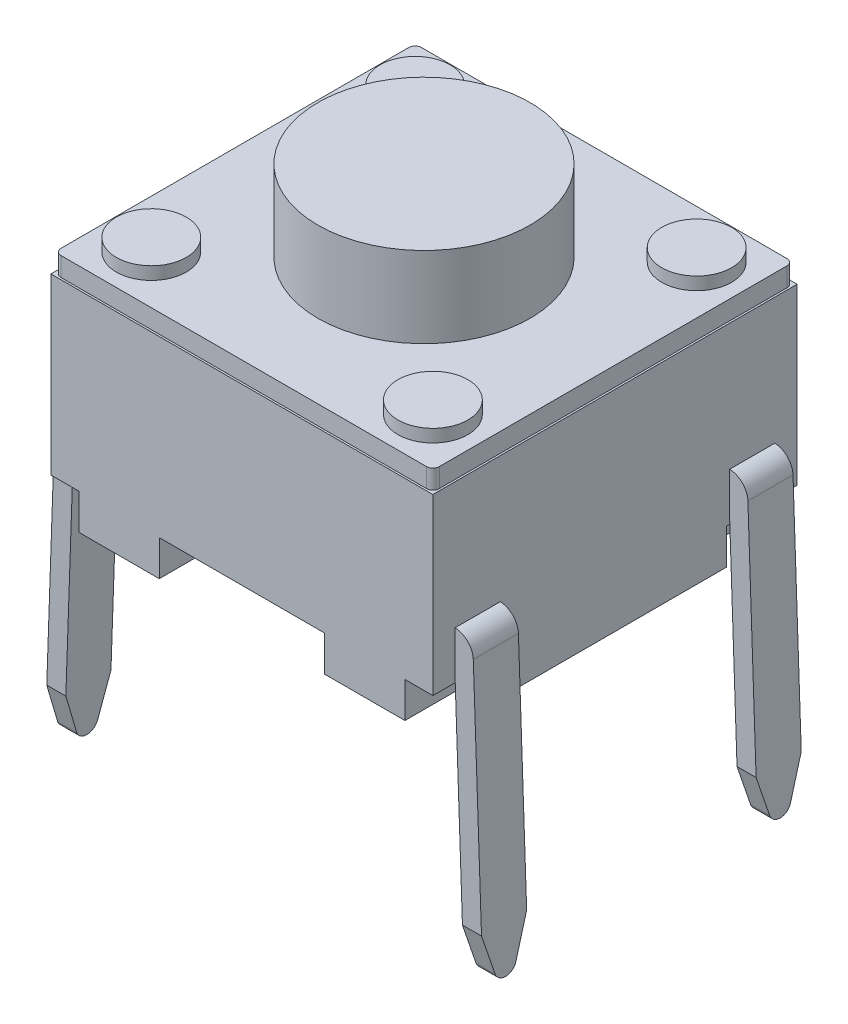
ISO-10303-21;
HEADER;
FILE_DESCRIPTION(('STEP AP214'),'2;1');
FILE_NAME('part.step','',(''),(''),'','','');
FILE_SCHEMA(('AUTOMOTIVE_DESIGN { 1 0 10303 214 1 1 1 1 }'));
ENDSEC;
DATA;
#1=APPLICATION_CONTEXT('core data for automotive mechanical design processes');
#2=APPLICATION_PROTOCOL_DEFINITION('international standard','automotive_design',2000,#1);
#3=PRODUCT_CONTEXT('',#1,'mechanical');
#4=PRODUCT('Part','Part','',(#3));
#5=PRODUCT_RELATED_PRODUCT_CATEGORY('part','',(#4));
#6=PRODUCT_DEFINITION_FORMATION('','',#4);
#7=PRODUCT_DEFINITION_CONTEXT('part definition',#1,'design');
#8=PRODUCT_DEFINITION('design','',#6,#7);
#9=PRODUCT_DEFINITION_SHAPE('','',#8);
#10=(LENGTH_UNIT() NAMED_UNIT(*) SI_UNIT(.MILLI.,.METRE.));
#11=(NAMED_UNIT(*) PLANE_ANGLE_UNIT() SI_UNIT($,.RADIAN.));
#12=(NAMED_UNIT(*) SI_UNIT($,.STERADIAN.) SOLID_ANGLE_UNIT());
#13=UNCERTAINTY_MEASURE_WITH_UNIT(LENGTH_MEASURE(1.E-05),#10,'distance_accuracy_value','');
#14=(GEOMETRIC_REPRESENTATION_CONTEXT(3) GLOBAL_UNCERTAINTY_ASSIGNED_CONTEXT((#13)) GLOBAL_UNIT_ASSIGNED_CONTEXT((#10,
#11,#12)) REPRESENTATION_CONTEXT('',''));
#15=CARTESIAN_POINT('',(0.,0.,0.));
#16=DIRECTION('',(0.,0.,1.));
#17=DIRECTION('',(1.,0.,0.));
#18=AXIS2_PLACEMENT_3D('',#15,#16,#17);
#19=CARTESIAN_POINT('',(0.03,3.,-5.35));
#20=DIRECTION('',(0.,1.,0.));
#21=DIRECTION('',(0.,0.,1.));
#22=AXIS2_PLACEMENT_3D('',#19,#20,#21);
#23=PLANE('',#22);
#24=CARTESIAN_POINT('',(5.22,3.,-0.44));
#25=DIRECTION('',(0.,1.,0.));
#26=DIRECTION('',(0.,0.,1.));
#27=AXIS2_PLACEMENT_3D('',#24,#25,#26);
#28=CIRCLE('',#27,0.55);
#29=CARTESIAN_POINT('',(5.22,3.,0.109999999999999));
#30=VERTEX_POINT('',#29);
#31=EDGE_CURVE('E942',#30,#30,#28,.T.);
#32=ORIENTED_EDGE('',*,*,#31,.F.);
#33=EDGE_LOOP('',(#32));
#34=FACE_BOUND('',#33,.T.);
#35=CARTESIAN_POINT('',(0.79,3.,-4.59));
#36=DIRECTION('',(0.,1.,0.));
#37=DIRECTION('',(0.,0.,1.));
#38=AXIS2_PLACEMENT_3D('',#35,#36,#37);
#39=CIRCLE('',#38,0.55);
#40=CARTESIAN_POINT('',(0.79,3.,-4.04));
#41=VERTEX_POINT('',#40);
#42=EDGE_CURVE('E930',#41,#41,#39,.T.);
#43=ORIENTED_EDGE('',*,*,#42,.F.);
#44=EDGE_LOOP('',(#43));
#45=FACE_BOUND('',#44,.T.);
#46=DIRECTION('',(-1.,0.,0.));
#47=VECTOR('',#46,1.);
#48=CARTESIAN_POINT('',(5.98,3.,-5.35));
#49=LINE('',#48,#47);
#50=CARTESIAN_POINT('',(5.88,3.,-5.35));
#51=VERTEX_POINT('',#50);
#52=CARTESIAN_POINT('',(0.13,3.,-5.35));
#53=VERTEX_POINT('',#52);
#54=EDGE_CURVE('E913',#51,#53,#49,.T.);
#55=ORIENTED_EDGE('',*,*,#54,.T.);
#56=CARTESIAN_POINT('',(0.13,3.,-5.25));
#57=DIRECTION('',(0.,1.,0.));
#58=DIRECTION('',(0.,0.,1.));
#59=AXIS2_PLACEMENT_3D('',#56,#57,#58);
#60=CIRCLE('',#59,0.1);
#61=CARTESIAN_POINT('',(0.03,3.,-5.25));
#62=VERTEX_POINT('',#61);
#63=EDGE_CURVE('E867',#53,#62,#60,.T.);
#64=ORIENTED_EDGE('',*,*,#63,.T.);
#65=DIRECTION('',(0.,0.,1.));
#66=VECTOR('',#65,1.);
#67=CARTESIAN_POINT('',(0.03,3.,-5.35));
#68=LINE('',#67,#66);
#69=CARTESIAN_POINT('',(0.03,3.,0.22));
#70=VERTEX_POINT('',#69);
#71=EDGE_CURVE('E908',#62,#70,#68,.T.);
#72=ORIENTED_EDGE('',*,*,#71,.T.);
#73=CARTESIAN_POINT('',(0.13,3.,0.22));
#74=DIRECTION('',(0.,1.,0.));
#75=DIRECTION('',(0.,0.,1.));
#76=AXIS2_PLACEMENT_3D('',#73,#74,#75);
#77=CIRCLE('',#76,0.1);
#78=CARTESIAN_POINT('',(0.13,3.,0.32));
#79=VERTEX_POINT('',#78);
#80=EDGE_CURVE('E865',#70,#79,#77,.T.);
#81=ORIENTED_EDGE('',*,*,#80,.T.);
#82=DIRECTION('',(1.,0.,0.));
#83=VECTOR('',#82,1.);
#84=CARTESIAN_POINT('',(0.03,3.,0.32));
#85=LINE('',#84,#83);
#86=CARTESIAN_POINT('',(5.88,3.,0.32));
#87=VERTEX_POINT('',#86);
#88=EDGE_CURVE('E903',#79,#87,#85,.T.);
#89=ORIENTED_EDGE('',*,*,#88,.T.);
#90=CARTESIAN_POINT('',(5.88,3.,0.22));
#91=DIRECTION('',(0.,1.,0.));
#92=DIRECTION('',(0.,0.,1.));
#93=AXIS2_PLACEMENT_3D('',#90,#91,#92);
#94=CIRCLE('',#93,0.1);
#95=CARTESIAN_POINT('',(5.98,3.,0.22));
#96=VERTEX_POINT('',#95);
#97=EDGE_CURVE('E863',#87,#96,#94,.T.);
#98=ORIENTED_EDGE('',*,*,#97,.T.);
#99=DIRECTION('',(0.,0.,-1.));
#100=VECTOR('',#99,1.);
#101=CARTESIAN_POINT('',(5.98,3.,0.32));
#102=LINE('',#101,#100);
#103=CARTESIAN_POINT('',(5.98,3.,-5.25));
#104=VERTEX_POINT('',#103);
#105=EDGE_CURVE('E901',#96,#104,#102,.T.);
#106=ORIENTED_EDGE('',*,*,#105,.T.);
#107=CARTESIAN_POINT('',(5.88,3.,-5.25));
#108=DIRECTION('',(0.,1.,0.));
#109=DIRECTION('',(0.,0.,1.));
#110=AXIS2_PLACEMENT_3D('',#107,#108,#109);
#111=CIRCLE('',#110,0.1);
#112=EDGE_CURVE('E861',#104,#51,#111,.T.);
#113=ORIENTED_EDGE('',*,*,#112,.T.);
#114=EDGE_LOOP('',(#55,#64,#72,#81,#89,#98,#106,#113));
#115=FACE_BOUND('',#114,.T.);
#116=CARTESIAN_POINT('',(3.005,3.,-2.515));
#117=DIRECTION('',(0.,1.,0.));
#118=DIRECTION('',(0.,0.,1.));
#119=AXIS2_PLACEMENT_3D('',#116,#117,#118);
#120=CIRCLE('',#119,1.67);
#121=CARTESIAN_POINT('',(3.005,3.,-0.845000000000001));
#122=VERTEX_POINT('',#121);
#123=EDGE_CURVE('E924',#122,#122,#120,.T.);
#124=ORIENTED_EDGE('',*,*,#123,.F.);
#125=EDGE_LOOP('',(#124));
#126=FACE_BOUND('',#125,.T.);
#127=CARTESIAN_POINT('',(0.79,3.,-0.44));
#128=DIRECTION('',(0.,1.,0.));
#129=DIRECTION('',(0.,0.,-1.));
#130=AXIS2_PLACEMENT_3D('',#127,#128,#129);
#131=CIRCLE('',#130,0.55);
#132=CARTESIAN_POINT('',(0.79,3.,-0.99));
#133=VERTEX_POINT('',#132);
#134=EDGE_CURVE('E936',#133,#133,#131,.T.);
#135=ORIENTED_EDGE('',*,*,#134,.F.);
#136=EDGE_LOOP('',(#135));
#137=FACE_BOUND('',#136,.T.);
#138=CARTESIAN_POINT('',(5.22,3.,-4.59));
#139=DIRECTION('',(0.,1.,0.));
#140=DIRECTION('',(0.,0.,-1.));
#141=AXIS2_PLACEMENT_3D('',#138,#139,#140);
#142=CIRCLE('',#141,0.55);
#143=CARTESIAN_POINT('',(5.22,3.,-5.14));
#144=VERTEX_POINT('',#143);
#145=EDGE_CURVE('E948',#144,#144,#142,.T.);
#146=ORIENTED_EDGE('',*,*,#145,.F.);
#147=EDGE_LOOP('',(#146));
#148=FACE_BOUND('',#147,.T.);
#149=ADVANCED_FACE('F27',(#34,#45,#115,#126,#137,#148),#23,.T.);
#150=CARTESIAN_POINT('',(0.,2.7,0.35));
#151=DIRECTION('',(0.,1.,0.));
#152=DIRECTION('',(0.,0.,1.));
#153=AXIS2_PLACEMENT_3D('',#150,#151,#152);
#154=PLANE('',#153);
#155=DIRECTION('',(0.,0.,1.));
#156=VECTOR('',#155,1.);
#157=CARTESIAN_POINT('',(0.,2.7,-5.38));
#158=LINE('',#157,#156);
#159=CARTESIAN_POINT('',(0.,2.7,-5.38));
#160=VERTEX_POINT('',#159);
#161=CARTESIAN_POINT('',(0.,2.7,0.35));
#162=VERTEX_POINT('',#161);
#163=EDGE_CURVE('E603',#160,#162,#158,.T.);
#164=ORIENTED_EDGE('',*,*,#163,.T.);
#165=DIRECTION('',(1.,0.,0.));
#166=VECTOR('',#165,1.);
#167=CARTESIAN_POINT('',(0.,2.7,0.35));
#168=LINE('',#167,#166);
#169=CARTESIAN_POINT('',(6.01,2.7,0.35));
#170=VERTEX_POINT('',#169);
#171=EDGE_CURVE('E618',#162,#170,#168,.T.);
#172=ORIENTED_EDGE('',*,*,#171,.T.);
#173=DIRECTION('',(0.,0.,-1.));
#174=VECTOR('',#173,1.);
#175=CARTESIAN_POINT('',(6.01,2.7,0.35));
#176=LINE('',#175,#174);
#177=CARTESIAN_POINT('',(6.01,2.7,-5.38));
#178=VERTEX_POINT('',#177);
#179=EDGE_CURVE('E621',#170,#178,#176,.T.);
#180=ORIENTED_EDGE('',*,*,#179,.T.);
#181=DIRECTION('',(-1.,0.,0.));
#182=VECTOR('',#181,1.);
#183=CARTESIAN_POINT('',(6.01,2.7,-5.38));
#184=LINE('',#183,#182);
#185=EDGE_CURVE('E624',#178,#160,#184,.T.);
#186=ORIENTED_EDGE('',*,*,#185,.T.);
#187=EDGE_LOOP('',(#164,#172,#180,#186));
#188=FACE_BOUND('',#187,.T.);
#189=DIRECTION('',(0.,0.,1.));
#190=VECTOR('',#189,1.);
#191=CARTESIAN_POINT('',(0.03,2.7,-5.35));
#192=LINE('',#191,#190);
#193=CARTESIAN_POINT('',(0.03,2.7,-5.25));
#194=VERTEX_POINT('',#193);
#195=CARTESIAN_POINT('',(0.03,2.7,0.22));
#196=VERTEX_POINT('',#195);
#197=EDGE_CURVE('E892',#194,#196,#192,.T.);
#198=ORIENTED_EDGE('',*,*,#197,.F.);
#199=CARTESIAN_POINT('',(0.13,2.7,-5.25));
#200=DIRECTION('',(0.,1.,0.));
#201=DIRECTION('',(0.,0.,1.));
#202=AXIS2_PLACEMENT_3D('',#199,#200,#201);
#203=CIRCLE('',#202,0.1);
#204=CARTESIAN_POINT('',(0.13,2.7,-5.35));
#205=VERTEX_POINT('',#204);
#206=EDGE_CURVE('E878',#194,#205,#203,.F.);
#207=ORIENTED_EDGE('',*,*,#206,.T.);
#208=DIRECTION('',(-1.,0.,0.));
#209=VECTOR('',#208,1.);
#210=CARTESIAN_POINT('',(5.98,2.7,-5.35));
#211=LINE('',#210,#209);
#212=CARTESIAN_POINT('',(5.88,2.7,-5.35));
#213=VERTEX_POINT('',#212);
#214=EDGE_CURVE('E918',#213,#205,#211,.T.);
#215=ORIENTED_EDGE('',*,*,#214,.F.);
#216=CARTESIAN_POINT('',(5.88,2.7,-5.25));
#217=DIRECTION('',(0.,1.,0.));
#218=DIRECTION('',(0.,0.,1.));
#219=AXIS2_PLACEMENT_3D('',#216,#217,#218);
#220=CIRCLE('',#219,0.1);
#221=CARTESIAN_POINT('',(5.98,2.7,-5.25));
#222=VERTEX_POINT('',#221);
#223=EDGE_CURVE('E11',#213,#222,#220,.F.);
#224=ORIENTED_EDGE('',*,*,#223,.T.);
#225=DIRECTION('',(0.,0.,-1.));
#226=VECTOR('',#225,1.);
#227=CARTESIAN_POINT('',(5.98,2.7,0.32));
#228=LINE('',#227,#226);
#229=CARTESIAN_POINT('',(5.98,2.7,0.22));
#230=VERTEX_POINT('',#229);
#231=EDGE_CURVE('E886',#230,#222,#228,.T.);
#232=ORIENTED_EDGE('',*,*,#231,.F.);
#233=CARTESIAN_POINT('',(5.88,2.7,0.22));
#234=DIRECTION('',(0.,1.,0.));
#235=DIRECTION('',(0.,0.,1.));
#236=AXIS2_PLACEMENT_3D('',#233,#234,#235);
#237=CIRCLE('',#236,0.1);
#238=CARTESIAN_POINT('',(5.88,2.7,0.32));
#239=VERTEX_POINT('',#238);
#240=EDGE_CURVE('E35',#230,#239,#237,.F.);
#241=ORIENTED_EDGE('',*,*,#240,.T.);
#242=DIRECTION('',(1.,0.,0.));
#243=VECTOR('',#242,1.);
#244=CARTESIAN_POINT('',(0.03,2.7,0.32));
#245=LINE('',#244,#243);
#246=CARTESIAN_POINT('',(0.13,2.7,0.32));
#247=VERTEX_POINT('',#246);
#248=EDGE_CURVE('E885',#247,#239,#245,.T.);
#249=ORIENTED_EDGE('',*,*,#248,.F.);
#250=CARTESIAN_POINT('',(0.13,2.7,0.22));
#251=DIRECTION('',(0.,1.,0.));
#252=DIRECTION('',(0.,0.,1.));
#253=AXIS2_PLACEMENT_3D('',#250,#251,#252);
#254=CIRCLE('',#253,0.1);
#255=EDGE_CURVE('E880',#247,#196,#254,.F.);
#256=ORIENTED_EDGE('',*,*,#255,.T.);
#257=EDGE_LOOP('',(#198,#207,#215,#224,#232,#241,#249,#256));
#258=FACE_BOUND('',#257,.T.);
#259=ADVANCED_FACE('F884',(#188,#258),#154,.T.);
#260=CARTESIAN_POINT('',(4.305,-0.6,0.35));
#261=DIRECTION('',(1.,0.,0.));
#262=DIRECTION('',(0.,0.,-1.));
#263=AXIS2_PLACEMENT_3D('',#260,#261,#262);
#264=PLANE('',#263);
#265=DIRECTION('',(0.,0.,-1.));
#266=VECTOR('',#265,1.);
#267=CARTESIAN_POINT('',(4.305,-0.6,0.35));
#268=LINE('',#267,#266);
#269=CARTESIAN_POINT('',(4.305,-0.6,-3.075));
#270=VERTEX_POINT('',#269);
#271=CARTESIAN_POINT('',(4.305,-0.6,-5.38));
#272=VERTEX_POINT('',#271);
#273=EDGE_CURVE('E599',#270,#272,#268,.T.);
#274=ORIENTED_EDGE('',*,*,#273,.F.);
#275=DIRECTION('',(0.,-1.,0.));
#276=VECTOR('',#275,1.);
#277=CARTESIAN_POINT('',(4.305,1.55812390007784,-3.075));
#278=LINE('',#277,#276);
#279=CARTESIAN_POINT('',(4.305,-0.0399999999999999,-3.075));
#280=VERTEX_POINT('',#279);
#281=EDGE_CURVE('E533',#280,#270,#278,.T.);
#282=ORIENTED_EDGE('',*,*,#281,.F.);
#283=DIRECTION('',(0.,0.,-1.));
#284=VECTOR('',#283,1.);
#285=CARTESIAN_POINT('',(4.305,-0.0399999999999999,0.35));
#286=LINE('',#285,#284);
#287=CARTESIAN_POINT('',(4.305,-0.0399999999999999,-5.38));
#288=VERTEX_POINT('',#287);
#289=EDGE_CURVE('E604',#280,#288,#286,.T.);
#290=ORIENTED_EDGE('',*,*,#289,.T.);
#291=DIRECTION('',(0.,-1.,0.));
#292=VECTOR('',#291,1.);
#293=CARTESIAN_POINT('',(4.305,-0.6,-5.38));
#294=LINE('',#293,#292);
#295=EDGE_CURVE('E581',#288,#272,#294,.T.);
#296=ORIENTED_EDGE('',*,*,#295,.T.);
#297=EDGE_LOOP('',(#274,#282,#290,#296));
#298=FACE_BOUND('',#297,.T.);
#299=ADVANCED_FACE('F961',(#298),#264,.F.);
#300=CARTESIAN_POINT('',(1.705,-0.6,0.35));
#301=DIRECTION('',(-1.,0.,0.));
#302=DIRECTION('',(0.,0.,1.));
#303=AXIS2_PLACEMENT_3D('',#300,#301,#302);
#304=PLANE('',#303);
#305=DIRECTION('',(0.,0.,-1.));
#306=VECTOR('',#305,1.);
#307=CARTESIAN_POINT('',(1.705,-0.6,0.35));
#308=LINE('',#307,#306);
#309=CARTESIAN_POINT('',(1.705,-0.6,0.35));
#310=VERTEX_POINT('',#309);
#311=CARTESIAN_POINT('',(1.705,-0.6,-1.955));
#312=VERTEX_POINT('',#311);
#313=EDGE_CURVE('E609',#310,#312,#308,.T.);
#314=ORIENTED_EDGE('',*,*,#313,.T.);
#315=DIRECTION('',(0.,-1.,0.));
#316=VECTOR('',#315,1.);
#317=CARTESIAN_POINT('',(1.705,1.55812390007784,-1.955));
#318=LINE('',#317,#316);
#319=CARTESIAN_POINT('',(1.705,-0.0399999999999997,-1.955));
#320=VERTEX_POINT('',#319);
#321=EDGE_CURVE('E577',#320,#312,#318,.T.);
#322=ORIENTED_EDGE('',*,*,#321,.F.);
#323=DIRECTION('',(0.,0.,-1.));
#324=VECTOR('',#323,1.);
#325=CARTESIAN_POINT('',(1.705,-0.0399999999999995,0.35));
#326=LINE('',#325,#324);
#327=CARTESIAN_POINT('',(1.705,-0.0399999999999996,0.35));
#328=VERTEX_POINT('',#327);
#329=EDGE_CURVE('E605',#328,#320,#326,.T.);
#330=ORIENTED_EDGE('',*,*,#329,.F.);
#331=DIRECTION('',(0.,1.,0.));
#332=VECTOR('',#331,1.);
#333=CARTESIAN_POINT('',(1.705,-0.6,0.35));
#334=LINE('',#333,#332);
#335=EDGE_CURVE('E593',#310,#328,#334,.T.);
#336=ORIENTED_EDGE('',*,*,#335,.F.);
#337=EDGE_LOOP('',(#314,#322,#330,#336));
#338=FACE_BOUND('',#337,.T.);
#339=ADVANCED_FACE('F1057',(#338),#304,.F.);
#340=CARTESIAN_POINT('',(0.,-0.6,-5.03));
#341=DIRECTION('',(0.,-1.,0.));
#342=DIRECTION('',(0.,0.,-1.));
#343=AXIS2_PLACEMENT_3D('',#340,#341,#342);
#344=PLANE('',#343);
#345=DIRECTION('',(0.,0.,-1.));
#346=VECTOR('',#345,1.);
#347=CARTESIAN_POINT('',(5.57,-0.6,0.35));
#348=LINE('',#347,#346);
#349=CARTESIAN_POINT('',(5.57,-0.6,0.35));
#350=VERTEX_POINT('',#349);
#351=CARTESIAN_POINT('',(5.57,-0.6,-0.76));
#352=VERTEX_POINT('',#351);
#353=EDGE_CURVE('E443',#350,#352,#348,.T.);
#354=ORIENTED_EDGE('',*,*,#353,.F.);
#355=DIRECTION('',(-1.,0.,0.));
#356=VECTOR('',#355,1.);
#357=CARTESIAN_POINT('',(6.01,-0.6,0.35));
#358=LINE('',#357,#356);
#359=CARTESIAN_POINT('',(4.305,-0.6,0.35));
#360=VERTEX_POINT('',#359);
#361=EDGE_CURVE('E631',#350,#360,#358,.T.);
#362=ORIENTED_EDGE('',*,*,#361,.T.);
#363=CARTESIAN_POINT('',(4.305,-0.6,-1.955));
#364=VERTEX_POINT('',#363);
#365=EDGE_CURVE('E613',#360,#364,#268,.T.);
#366=ORIENTED_EDGE('',*,*,#365,.T.);
#367=DIRECTION('',(-1.,0.,0.));
#368=VECTOR('',#367,1.);
#369=CARTESIAN_POINT('',(4.305,-0.6,-1.955));
#370=LINE('',#369,#368);
#371=CARTESIAN_POINT('',(5.445,-0.6,-1.955));
#372=VERTEX_POINT('',#371);
#373=EDGE_CURVE('E529',#372,#364,#370,.T.);
#374=ORIENTED_EDGE('',*,*,#373,.F.);
#375=DIRECTION('',(0.,0.,1.));
#376=VECTOR('',#375,1.);
#377=CARTESIAN_POINT('',(5.445,-0.6,-1.955));
#378=LINE('',#377,#376);
#379=CARTESIAN_POINT('',(5.445,-0.6,-3.075));
#380=VERTEX_POINT('',#379);
#381=EDGE_CURVE('E530',#380,#372,#378,.T.);
#382=ORIENTED_EDGE('',*,*,#381,.F.);
#383=DIRECTION('',(1.,0.,0.));
#384=VECTOR('',#383,1.);
#385=CARTESIAN_POINT('',(4.305,-0.6,-3.075));
#386=LINE('',#385,#384);
#387=EDGE_CURVE('E534',#270,#380,#386,.T.);
#388=ORIENTED_EDGE('',*,*,#387,.F.);
#389=ORIENTED_EDGE('',*,*,#273,.T.);
#390=DIRECTION('',(-1.,0.,0.));
#391=VECTOR('',#390,1.);
#392=CARTESIAN_POINT('',(6.01,-0.6,-5.38));
#393=LINE('',#392,#391);
#394=CARTESIAN_POINT('',(5.57,-0.6,-5.38));
#395=VERTEX_POINT('',#394);
#396=EDGE_CURVE('E639',#395,#272,#393,.T.);
#397=ORIENTED_EDGE('',*,*,#396,.F.);
#398=DIRECTION('',(0.,0.,-1.));
#399=VECTOR('',#398,1.);
#400=CARTESIAN_POINT('',(5.57,-0.6,-5.38));
#401=LINE('',#400,#399);
#402=CARTESIAN_POINT('',(5.57,-0.6,-4.27));
#403=VERTEX_POINT('',#402);
#404=EDGE_CURVE('E507',#403,#395,#401,.T.);
#405=ORIENTED_EDGE('',*,*,#404,.F.);
#406=DIRECTION('',(-1.,0.,0.));
#407=VECTOR('',#406,1.);
#408=CARTESIAN_POINT('',(6.01,-0.6,-4.27));
#409=LINE('',#408,#407);
#410=CARTESIAN_POINT('',(6.01,-0.6,-4.27));
#411=VERTEX_POINT('',#410);
#412=EDGE_CURVE('E506',#411,#403,#409,.T.);
#413=ORIENTED_EDGE('',*,*,#412,.F.);
#414=DIRECTION('',(0.,0.,1.));
#415=VECTOR('',#414,1.);
#416=CARTESIAN_POINT('',(6.01,-0.6,-5.03));
#417=LINE('',#416,#415);
#418=CARTESIAN_POINT('',(6.01,-0.6,-0.76));
#419=VERTEX_POINT('',#418);
#420=EDGE_CURVE('E661',#411,#419,#417,.T.);
#421=ORIENTED_EDGE('',*,*,#420,.T.);
#422=DIRECTION('',(1.,0.,0.));
#423=VECTOR('',#422,1.);
#424=CARTESIAN_POINT('',(6.01,-0.6,-0.76));
#425=LINE('',#424,#423);
#426=EDGE_CURVE('E449',#352,#419,#425,.T.);
#427=ORIENTED_EDGE('',*,*,#426,.F.);
#428=EDGE_LOOP('',(#354,#362,#366,#374,#382,#388,#389,#397,#405,#413,#421,#427));
#429=FACE_BOUND('',#428,.T.);
#430=ADVANCED_FACE('F1074',(#429),#344,.T.);
#431=CARTESIAN_POINT('',(0.,0.71,0.));
#432=DIRECTION('',(0.,0.,-1.));
#433=DIRECTION('',(-1.,0.,0.));
#434=AXIS2_PLACEMENT_3D('',#431,#432,#433);
#435=PLANE('',#434);
#436=DIRECTION('',(0.,1.,0.));
#437=VECTOR('',#436,1.);
#438=CARTESIAN_POINT('',(6.01,0.71,0.));
#439=LINE('',#438,#437);
#440=CARTESIAN_POINT('',(6.01,0.,0.));
#441=VERTEX_POINT('',#440);
#442=CARTESIAN_POINT('',(6.01,0.709658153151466,0.));
#443=VERTEX_POINT('',#442);
#444=EDGE_CURVE('E657',#441,#443,#439,.T.);
#445=ORIENTED_EDGE('',*,*,#444,.F.);
#446=DIRECTION('',(0.0348994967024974,-0.999390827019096,0.));
#447=VECTOR('',#446,1.);
#448=CARTESIAN_POINT('',(5.98520625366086,0.71,0.));
#449=LINE('',#448,#447);
#450=CARTESIAN_POINT('',(6.12470489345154,-3.28471838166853,0.));
#451=VERTEX_POINT('',#450);
#452=EDGE_CURVE('E788',#441,#451,#449,.T.);
#453=ORIENTED_EDGE('',*,*,#452,.T.);
#454=DIRECTION('',(1.,0.,0.));
#455=VECTOR('',#454,1.);
#456=CARTESIAN_POINT('',(0.,-3.28471838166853,0.));
#457=LINE('',#456,#455);
#458=CARTESIAN_POINT('',(6.42488775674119,-3.28471838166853,0.));
#459=VERTEX_POINT('',#458);
#460=EDGE_CURVE('E737',#451,#459,#457,.T.);
#461=ORIENTED_EDGE('',*,*,#460,.T.);
#462=DIRECTION('',(-0.0348994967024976,0.999390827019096,0.));
#463=VECTOR('',#462,1.);
#464=CARTESIAN_POINT('',(6.28538911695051,0.71,0.));
#465=LINE('',#464,#463);
#466=CARTESIAN_POINT('',(6.29549973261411,0.420469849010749,0.));
#467=VERTEX_POINT('',#466);
#468=EDGE_CURVE('E786',#459,#467,#465,.T.);
#469=ORIENTED_EDGE('',*,*,#468,.T.);
#470=CARTESIAN_POINT('',(5.99568248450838,0.41,0.));
#471=DIRECTION('',(0.,0.,-1.));
#472=DIRECTION('',(-1.,0.,0.));
#473=AXIS2_PLACEMENT_3D('',#470,#471,#472);
#474=CIRCLE('',#473,0.3);
#475=EDGE_CURVE('E806',#467,#443,#474,.F.);
#476=ORIENTED_EDGE('',*,*,#475,.T.);
#477=EDGE_LOOP('',(#445,#453,#461,#469,#476));
#478=FACE_BOUND('',#477,.T.);
#479=ADVANCED_FACE('F1171',(#478),#435,.F.);
#480=DIRECTION('',(0.,-1.,0.));
#481=VECTOR('',#480,1.);
#482=CARTESIAN_POINT('',(0.,0.71,0.));
#483=LINE('',#482,#481);
#484=CARTESIAN_POINT('',(0.,0.709658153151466,0.));
#485=VERTEX_POINT('',#484);
#486=CARTESIAN_POINT('',(0.,0.,0.));
#487=VERTEX_POINT('',#486);
#488=EDGE_CURVE('E649',#485,#487,#483,.T.);
#489=ORIENTED_EDGE('',*,*,#488,.F.);
#490=CARTESIAN_POINT('',(0.0143175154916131,0.41,0.));
#491=DIRECTION('',(0.,0.,-1.));
#492=DIRECTION('',(-1.,0.,0.));
#493=AXIS2_PLACEMENT_3D('',#490,#491,#492);
#494=CIRCLE('',#493,0.3);
#495=CARTESIAN_POINT('',(-0.285499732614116,0.420469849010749,0.));
#496=VERTEX_POINT('',#495);
#497=EDGE_CURVE('E809',#485,#496,#494,.F.);
#498=ORIENTED_EDGE('',*,*,#497,.T.);
#499=DIRECTION('',(-0.0348994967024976,-0.999390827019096,0.));
#500=VECTOR('',#499,1.);
#501=CARTESIAN_POINT('',(-0.27538911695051,0.71,0.));
#502=LINE('',#501,#500);
#503=CARTESIAN_POINT('',(-0.414887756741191,-3.28471838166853,0.));
#504=VERTEX_POINT('',#503);
#505=EDGE_CURVE('E774',#496,#504,#502,.T.);
#506=ORIENTED_EDGE('',*,*,#505,.T.);
#507=CARTESIAN_POINT('',(-0.114704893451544,-3.28471838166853,0.));
#508=VERTEX_POINT('',#507);
#509=EDGE_CURVE('E733',#504,#508,#457,.T.);
#510=ORIENTED_EDGE('',*,*,#509,.T.);
#511=DIRECTION('',(0.0348994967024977,0.999390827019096,0.));
#512=VECTOR('',#511,1.);
#513=CARTESIAN_POINT('',(0.0247937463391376,0.71,0.));
#514=LINE('',#513,#512);
#515=EDGE_CURVE('E771',#508,#487,#514,.T.);
#516=ORIENTED_EDGE('',*,*,#515,.T.);
#517=EDGE_LOOP('',(#489,#498,#506,#510,#516));
#518=FACE_BOUND('',#517,.T.);
#519=ADVANCED_FACE('F1167',(#518),#435,.F.);
#520=CARTESIAN_POINT('',(0.,0.71,-5.03));
#521=DIRECTION('',(0.,0.,1.));
#522=DIRECTION('',(1.,0.,0.));
#523=AXIS2_PLACEMENT_3D('',#520,#521,#522);
#524=PLANE('',#523);
#525=DIRECTION('',(0.,-1.,0.));
#526=VECTOR('',#525,1.);
#527=CARTESIAN_POINT('',(6.01,0.71,-5.03));
#528=LINE('',#527,#526);
#529=CARTESIAN_POINT('',(6.01,0.709658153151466,-5.03));
#530=VERTEX_POINT('',#529);
#531=CARTESIAN_POINT('',(6.01,0.,-5.03));
#532=VERTEX_POINT('',#531);
#533=EDGE_CURVE('E655',#530,#532,#528,.T.);
#534=ORIENTED_EDGE('',*,*,#533,.F.);
#535=CARTESIAN_POINT('',(5.99568248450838,0.41,-5.03));
#536=DIRECTION('',(0.,0.,1.));
#537=DIRECTION('',(1.,0.,0.));
#538=AXIS2_PLACEMENT_3D('',#535,#536,#537);
#539=CIRCLE('',#538,0.3);
#540=CARTESIAN_POINT('',(6.29549973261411,0.420469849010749,-5.03));
#541=VERTEX_POINT('',#540);
#542=EDGE_CURVE('E820',#530,#541,#539,.F.);
#543=ORIENTED_EDGE('',*,*,#542,.T.);
#544=DIRECTION('',(-0.0348994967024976,0.999390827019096,0.));
#545=VECTOR('',#544,1.);
#546=CARTESIAN_POINT('',(6.28538911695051,0.71,-5.03));
#547=LINE('',#546,#545);
#548=CARTESIAN_POINT('',(6.42488775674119,-3.28471838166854,-5.03));
#549=VERTEX_POINT('',#548);
#550=EDGE_CURVE('E760',#549,#541,#547,.T.);
#551=ORIENTED_EDGE('',*,*,#550,.F.);
#552=DIRECTION('',(-1.,0.,0.));
#553=VECTOR('',#552,1.);
#554=CARTESIAN_POINT('',(0.,-3.28471838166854,-5.03));
#555=LINE('',#554,#553);
#556=CARTESIAN_POINT('',(6.12470489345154,-3.28471838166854,-5.03));
#557=VERTEX_POINT('',#556);
#558=EDGE_CURVE('E699',#549,#557,#555,.T.);
#559=ORIENTED_EDGE('',*,*,#558,.T.);
#560=DIRECTION('',(0.0348994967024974,-0.999390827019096,0.));
#561=VECTOR('',#560,1.);
#562=CARTESIAN_POINT('',(5.98520625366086,0.71,-5.03));
#563=LINE('',#562,#561);
#564=EDGE_CURVE('E757',#532,#557,#563,.T.);
#565=ORIENTED_EDGE('',*,*,#564,.F.);
#566=EDGE_LOOP('',(#534,#543,#551,#559,#565));
#567=FACE_BOUND('',#566,.T.);
#568=ADVANCED_FACE('F1164',(#567),#524,.F.);
#569=DIRECTION('',(0.,1.,0.));
#570=VECTOR('',#569,1.);
#571=CARTESIAN_POINT('',(0.,0.71,-5.03));
#572=LINE('',#571,#570);
#573=CARTESIAN_POINT('',(0.,0.,-5.03));
#574=VERTEX_POINT('',#573);
#575=CARTESIAN_POINT('',(0.,0.709658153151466,-5.03));
#576=VERTEX_POINT('',#575);
#577=EDGE_CURVE('E647',#574,#576,#572,.T.);
#578=ORIENTED_EDGE('',*,*,#577,.F.);
#579=DIRECTION('',(0.0348994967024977,0.999390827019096,0.));
#580=VECTOR('',#579,1.);
#581=CARTESIAN_POINT('',(0.0247937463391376,0.71,-5.03));
#582=LINE('',#581,#580);
#583=CARTESIAN_POINT('',(-0.114704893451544,-3.28471838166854,-5.03));
#584=VERTEX_POINT('',#583);
#585=EDGE_CURVE('E743',#584,#574,#582,.T.);
#586=ORIENTED_EDGE('',*,*,#585,.F.);
#587=CARTESIAN_POINT('',(-0.414887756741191,-3.28471838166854,-5.03));
#588=VERTEX_POINT('',#587);
#589=EDGE_CURVE('E695',#584,#588,#555,.T.);
#590=ORIENTED_EDGE('',*,*,#589,.T.);
#591=DIRECTION('',(-0.0348994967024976,-0.999390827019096,0.));
#592=VECTOR('',#591,1.);
#593=CARTESIAN_POINT('',(-0.27538911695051,0.71,-5.03));
#594=LINE('',#593,#592);
#595=CARTESIAN_POINT('',(-0.285499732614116,0.420469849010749,-5.03));
#596=VERTEX_POINT('',#595);
#597=EDGE_CURVE('E746',#596,#588,#594,.T.);
#598=ORIENTED_EDGE('',*,*,#597,.F.);
#599=CARTESIAN_POINT('',(0.0143175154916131,0.41,-5.03));
#600=DIRECTION('',(0.,0.,1.));
#601=DIRECTION('',(1.,0.,0.));
#602=AXIS2_PLACEMENT_3D('',#599,#600,#601);
#603=CIRCLE('',#602,0.3);
#604=EDGE_CURVE('E822',#596,#576,#603,.F.);
#605=ORIENTED_EDGE('',*,*,#604,.T.);
#606=EDGE_LOOP('',(#578,#586,#590,#598,#605));
#607=FACE_BOUND('',#606,.T.);
#608=ADVANCED_FACE('F1114',(#607),#524,.F.);
#609=CARTESIAN_POINT('',(0.0143175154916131,0.41,-5.03));
#610=DIRECTION('',(0.,0.,-1.));
#611=DIRECTION('',(-1.,0.,0.));
#612=AXIS2_PLACEMENT_3D('',#609,#610,#611);
#613=CYLINDRICAL_SURFACE('',#612,0.3);
#614=ORIENTED_EDGE('',*,*,#497,.F.);
#615=DIRECTION('',(0.,0.,-1.));
#616=VECTOR('',#615,1.);
#617=CARTESIAN_POINT('',(0.,0.709658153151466,-5.03));
#618=LINE('',#617,#616);
#619=CARTESIAN_POINT('',(0.,0.709658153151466,-0.71));
#620=VERTEX_POINT('',#619);
#621=EDGE_CURVE('E646',#485,#620,#618,.T.);
#622=ORIENTED_EDGE('',*,*,#621,.T.);
#623=CARTESIAN_POINT('',(0.0143175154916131,0.41,-0.71));
#624=DIRECTION('',(0.,0.,-1.));
#625=DIRECTION('',(-1.,0.,0.));
#626=AXIS2_PLACEMENT_3D('',#623,#624,#625);
#627=CIRCLE('',#626,0.3);
#628=CARTESIAN_POINT('',(-0.285499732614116,0.420469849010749,-0.71));
#629=VERTEX_POINT('',#628);
#630=EDGE_CURVE('E813',#629,#620,#627,.T.);
#631=ORIENTED_EDGE('',*,*,#630,.F.);
#632=DIRECTION('',(0.,0.,1.));
#633=VECTOR('',#632,1.);
#634=CARTESIAN_POINT('',(-0.285499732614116,0.420469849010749,-0.71));
#635=LINE('',#634,#633);
#636=EDGE_CURVE('E811',#496,#629,#635,.F.);
#637=ORIENTED_EDGE('',*,*,#636,.F.);
#638=EDGE_LOOP('',(#614,#622,#631,#637));
#639=FACE_BOUND('',#638,.T.);
#640=ADVANCED_FACE('F1111',(#639),#613,.T.);
#641=CARTESIAN_POINT('',(0.0143175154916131,0.41,-4.32));
#642=DIRECTION('',(0.,0.,1.));
#643=DIRECTION('',(1.,0.,0.));
#644=AXIS2_PLACEMENT_3D('',#641,#642,#643);
#645=CIRCLE('',#644,0.3);
#646=CARTESIAN_POINT('',(0.,0.709658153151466,-4.32));
#647=VERTEX_POINT('',#646);
#648=CARTESIAN_POINT('',(-0.285499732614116,0.420469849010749,-4.32));
#649=VERTEX_POINT('',#648);
#650=EDGE_CURVE('E816',#647,#649,#645,.T.);
#651=ORIENTED_EDGE('',*,*,#650,.F.);
#652=EDGE_CURVE('E643',#647,#576,#618,.T.);
#653=ORIENTED_EDGE('',*,*,#652,.T.);
#654=ORIENTED_EDGE('',*,*,#604,.F.);
#655=DIRECTION('',(0.,0.,-1.));
#656=VECTOR('',#655,1.);
#657=CARTESIAN_POINT('',(-0.285499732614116,0.420469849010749,-4.675));
#658=LINE('',#657,#656);
#659=EDGE_CURVE('E818',#649,#596,#658,.T.);
#660=ORIENTED_EDGE('',*,*,#659,.F.);
#661=EDGE_LOOP('',(#651,#653,#654,#660));
#662=FACE_BOUND('',#661,.T.);
#663=ADVANCED_FACE('F1109',(#662),#613,.T.);
#664=CARTESIAN_POINT('',(5.99568248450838,0.41,-0.71));
#665=DIRECTION('',(0.,0.,-1.));
#666=DIRECTION('',(-1.,0.,0.));
#667=AXIS2_PLACEMENT_3D('',#664,#665,#666);
#668=CYLINDRICAL_SURFACE('',#667,0.3);
#669=ORIENTED_EDGE('',*,*,#542,.F.);
#670=DIRECTION('',(0.,0.,-1.));
#671=VECTOR('',#670,1.);
#672=CARTESIAN_POINT('',(6.01,0.709658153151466,-0.71));
#673=LINE('',#672,#671);
#674=CARTESIAN_POINT('',(6.01,0.709658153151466,-4.32));
#675=VERTEX_POINT('',#674);
#676=EDGE_CURVE('E654',#530,#675,#673,.F.);
#677=ORIENTED_EDGE('',*,*,#676,.T.);
#678=CARTESIAN_POINT('',(5.99568248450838,0.41,-4.32));
#679=DIRECTION('',(0.,0.,1.));
#680=DIRECTION('',(1.,0.,0.));
#681=AXIS2_PLACEMENT_3D('',#678,#679,#680);
#682=CIRCLE('',#681,0.3);
#683=CARTESIAN_POINT('',(6.29549973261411,0.420469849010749,-4.32));
#684=VERTEX_POINT('',#683);
#685=EDGE_CURVE('E831',#684,#675,#682,.T.);
#686=ORIENTED_EDGE('',*,*,#685,.F.);
#687=DIRECTION('',(0.,0.,-1.));
#688=VECTOR('',#687,1.);
#689=CARTESIAN_POINT('',(6.29549973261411,0.420469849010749,-4.675));
#690=LINE('',#689,#688);
#691=EDGE_CURVE('E828',#541,#684,#690,.F.);
#692=ORIENTED_EDGE('',*,*,#691,.F.);
#693=EDGE_LOOP('',(#669,#677,#686,#692));
#694=FACE_BOUND('',#693,.T.);
#695=ADVANCED_FACE('F1105',(#694),#668,.T.);
#696=CARTESIAN_POINT('',(5.99568248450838,0.41,-0.71));
#697=DIRECTION('',(0.,0.,-1.));
#698=DIRECTION('',(-1.,0.,0.));
#699=AXIS2_PLACEMENT_3D('',#696,#697,#698);
#700=CIRCLE('',#699,0.3);
#701=CARTESIAN_POINT('',(6.01,0.709658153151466,-0.71));
#702=VERTEX_POINT('',#701);
#703=CARTESIAN_POINT('',(6.29549973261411,0.420469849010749,-0.71));
#704=VERTEX_POINT('',#703);
#705=EDGE_CURVE('E834',#702,#704,#700,.T.);
#706=ORIENTED_EDGE('',*,*,#705,.F.);
#707=EDGE_CURVE('E651',#702,#443,#673,.F.);
#708=ORIENTED_EDGE('',*,*,#707,.T.);
#709=ORIENTED_EDGE('',*,*,#475,.F.);
#710=DIRECTION('',(0.,0.,1.));
#711=VECTOR('',#710,1.);
#712=CARTESIAN_POINT('',(6.29549973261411,0.420469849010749,0.));
#713=LINE('',#712,#711);
#714=EDGE_CURVE('E825',#704,#467,#713,.T.);
#715=ORIENTED_EDGE('',*,*,#714,.F.);
#716=EDGE_LOOP('',(#706,#708,#709,#715));
#717=FACE_BOUND('',#716,.T.);
#718=ADVANCED_FACE('F1108',(#717),#668,.T.);
#719=CARTESIAN_POINT('',(0.,0.71,0.));
#720=DIRECTION('',(1.,0.,0.));
#721=DIRECTION('',(0.,0.,-1.));
#722=AXIS2_PLACEMENT_3D('',#719,#720,#721);
#723=PLANE('',#722);
#724=ORIENTED_EDGE('',*,*,#488,.T.);
#725=DIRECTION('',(0.,0.,1.));
#726=VECTOR('',#725,1.);
#727=CARTESIAN_POINT('',(0.,0.,0.));
#728=LINE('',#727,#726);
#729=CARTESIAN_POINT('',(0.,0.,-0.71));
#730=VERTEX_POINT('',#729);
#731=EDGE_CURVE('E798',#730,#487,#728,.T.);
#732=ORIENTED_EDGE('',*,*,#731,.F.);
#733=DIRECTION('',(0.,1.,0.));
#734=VECTOR('',#733,1.);
#735=CARTESIAN_POINT('',(0.,0.71,-0.71));
#736=LINE('',#735,#734);
#737=EDGE_CURVE('E783',#730,#620,#736,.T.);
#738=ORIENTED_EDGE('',*,*,#737,.T.);
#739=ORIENTED_EDGE('',*,*,#621,.F.);
#740=EDGE_LOOP('',(#724,#732,#738,#739));
#741=FACE_BOUND('',#740,.T.);
#742=CARTESIAN_POINT('',(0.,0.,-4.32));
#743=VERTEX_POINT('',#742);
#744=EDGE_CURVE('E799',#574,#743,#728,.T.);
#745=ORIENTED_EDGE('',*,*,#744,.F.);
#746=ORIENTED_EDGE('',*,*,#577,.T.);
#747=ORIENTED_EDGE('',*,*,#652,.F.);
#748=DIRECTION('',(0.,-1.,0.));
#749=VECTOR('',#748,1.);
#750=CARTESIAN_POINT('',(0.,0.71,-4.32));
#751=LINE('',#750,#749);
#752=EDGE_CURVE('E754',#647,#743,#751,.T.);
#753=ORIENTED_EDGE('',*,*,#752,.T.);
#754=EDGE_LOOP('',(#745,#746,#747,#753));
#755=FACE_BOUND('',#754,.T.);
#756=DIRECTION('',(0.,-1.,0.));
#757=VECTOR('',#756,1.);
#758=CARTESIAN_POINT('',(0.,1.15402680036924,-0.76));
#759=LINE('',#758,#757);
#760=CARTESIAN_POINT('',(0.,-0.0399999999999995,-0.76));
#761=VERTEX_POINT('',#760);
#762=CARTESIAN_POINT('',(0.,-0.6,-0.76));
#763=VERTEX_POINT('',#762);
#764=EDGE_CURVE('E472',#761,#763,#759,.T.);
#765=ORIENTED_EDGE('',*,*,#764,.F.);
#766=DIRECTION('',(0.,0.,-1.));
#767=VECTOR('',#766,1.);
#768=CARTESIAN_POINT('',(0.,-0.0399999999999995,0.35));
#769=LINE('',#768,#767);
#770=CARTESIAN_POINT('',(0.,-0.0399999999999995,0.35));
#771=VERTEX_POINT('',#770);
#772=EDGE_CURVE('E469',#771,#761,#769,.T.);
#773=ORIENTED_EDGE('',*,*,#772,.F.);
#774=DIRECTION('',(0.,1.,0.));
#775=VECTOR('',#774,1.);
#776=CARTESIAN_POINT('',(0.,-0.6,0.35));
#777=LINE('',#776,#775);
#778=EDGE_CURVE('E633',#771,#162,#777,.T.);
#779=ORIENTED_EDGE('',*,*,#778,.T.);
#780=ORIENTED_EDGE('',*,*,#163,.F.);
#781=DIRECTION('',(0.,1.,0.));
#782=VECTOR('',#781,1.);
#783=CARTESIAN_POINT('',(0.,-0.6,-5.38));
#784=LINE('',#783,#782);
#785=CARTESIAN_POINT('',(0.,-0.0399999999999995,-5.38));
#786=VERTEX_POINT('',#785);
#787=EDGE_CURVE('E641',#786,#160,#784,.T.);
#788=ORIENTED_EDGE('',*,*,#787,.F.);
#789=DIRECTION('',(0.,0.,-1.));
#790=VECTOR('',#789,1.);
#791=CARTESIAN_POINT('',(0.,-0.0399999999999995,-5.38));
#792=LINE('',#791,#790);
#793=CARTESIAN_POINT('',(0.,-0.0399999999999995,-4.27));
#794=VERTEX_POINT('',#793);
#795=EDGE_CURVE('E496',#794,#786,#792,.T.);
#796=ORIENTED_EDGE('',*,*,#795,.F.);
#797=DIRECTION('',(0.,-1.,0.));
#798=VECTOR('',#797,1.);
#799=CARTESIAN_POINT('',(0.,1.15402680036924,-4.27));
#800=LINE('',#799,#798);
#801=CARTESIAN_POINT('',(0.,-0.6,-4.27));
#802=VERTEX_POINT('',#801);
#803=EDGE_CURVE('E498',#794,#802,#800,.T.);
#804=ORIENTED_EDGE('',*,*,#803,.T.);
#805=DIRECTION('',(0.,0.,-1.));
#806=VECTOR('',#805,1.);
#807=CARTESIAN_POINT('',(0.,-0.6,-0.71));
#808=LINE('',#807,#806);
#809=EDGE_CURVE('E659',#763,#802,#808,.T.);
#810=ORIENTED_EDGE('',*,*,#809,.F.);
#811=EDGE_LOOP('',(#765,#773,#779,#780,#788,#796,#804,#810));
#812=FACE_BOUND('',#811,.T.);
#813=ADVANCED_FACE('F29',(#741,#755,#812),#723,.F.);
#814=CARTESIAN_POINT('',(6.01,0.71,0.));
#815=DIRECTION('',(-1.,0.,0.));
#816=DIRECTION('',(0.,0.,1.));
#817=AXIS2_PLACEMENT_3D('',#814,#815,#816);
#818=PLANE('',#817);
#819=DIRECTION('',(0.,0.,-1.));
#820=VECTOR('',#819,1.);
#821=CARTESIAN_POINT('',(6.01,0.,0.));
#822=LINE('',#821,#820);
#823=CARTESIAN_POINT('',(6.01,0.,-0.71));
#824=VERTEX_POINT('',#823);
#825=EDGE_CURVE('E803',#441,#824,#822,.T.);
#826=ORIENTED_EDGE('',*,*,#825,.F.);
#827=ORIENTED_EDGE('',*,*,#444,.T.);
#828=ORIENTED_EDGE('',*,*,#707,.F.);
#829=DIRECTION('',(0.,-1.,0.));
#830=VECTOR('',#829,1.);
#831=CARTESIAN_POINT('',(6.01,0.71,-0.71));
#832=LINE('',#831,#830);
#833=EDGE_CURVE('E796',#702,#824,#832,.T.);
#834=ORIENTED_EDGE('',*,*,#833,.T.);
#835=EDGE_LOOP('',(#826,#827,#828,#834));
#836=FACE_BOUND('',#835,.T.);
#837=ORIENTED_EDGE('',*,*,#533,.T.);
#838=CARTESIAN_POINT('',(6.01,0.,-4.32));
#839=VERTEX_POINT('',#838);
#840=EDGE_CURVE('E802',#839,#532,#822,.T.);
#841=ORIENTED_EDGE('',*,*,#840,.F.);
#842=DIRECTION('',(0.,1.,0.));
#843=VECTOR('',#842,1.);
#844=CARTESIAN_POINT('',(6.01,0.71,-4.32));
#845=LINE('',#844,#843);
#846=EDGE_CURVE('E768',#839,#675,#845,.T.);
#847=ORIENTED_EDGE('',*,*,#846,.T.);
#848=ORIENTED_EDGE('',*,*,#676,.F.);
#849=EDGE_LOOP('',(#837,#841,#847,#848));
#850=FACE_BOUND('',#849,.T.);
#851=DIRECTION('',(0.,-1.,0.));
#852=VECTOR('',#851,1.);
#853=CARTESIAN_POINT('',(6.01,-0.6,0.35));
#854=LINE('',#853,#852);
#855=CARTESIAN_POINT('',(6.01,-0.0400000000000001,0.35));
#856=VERTEX_POINT('',#855);
#857=EDGE_CURVE('E627',#170,#856,#854,.T.);
#858=ORIENTED_EDGE('',*,*,#857,.T.);
#859=DIRECTION('',(0.,0.,1.));
#860=VECTOR('',#859,1.);
#861=CARTESIAN_POINT('',(6.01,-0.0400000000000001,0.35));
#862=LINE('',#861,#860);
#863=CARTESIAN_POINT('',(6.01,-0.0400000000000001,-0.76));
#864=VERTEX_POINT('',#863);
#865=EDGE_CURVE('E456',#864,#856,#862,.T.);
#866=ORIENTED_EDGE('',*,*,#865,.F.);
#867=DIRECTION('',(0.,-1.,0.));
#868=VECTOR('',#867,1.);
#869=CARTESIAN_POINT('',(6.01,1.15402680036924,-0.76));
#870=LINE('',#869,#868);
#871=EDGE_CURVE('E432',#864,#419,#870,.T.);
#872=ORIENTED_EDGE('',*,*,#871,.T.);
#873=ORIENTED_EDGE('',*,*,#420,.F.);
#874=DIRECTION('',(0.,-1.,0.));
#875=VECTOR('',#874,1.);
#876=CARTESIAN_POINT('',(6.01,1.15402680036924,-4.27));
#877=LINE('',#876,#875);
#878=CARTESIAN_POINT('',(6.01,-0.0400000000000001,-4.27));
#879=VERTEX_POINT('',#878);
#880=EDGE_CURVE('E518',#879,#411,#877,.T.);
#881=ORIENTED_EDGE('',*,*,#880,.F.);
#882=DIRECTION('',(0.,0.,1.));
#883=VECTOR('',#882,1.);
#884=CARTESIAN_POINT('',(6.01,-0.0400000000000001,-5.38));
#885=LINE('',#884,#883);
#886=CARTESIAN_POINT('',(6.01,-0.0400000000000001,-5.38));
#887=VERTEX_POINT('',#886);
#888=EDGE_CURVE('E515',#887,#879,#885,.T.);
#889=ORIENTED_EDGE('',*,*,#888,.F.);
#890=DIRECTION('',(0.,-1.,0.));
#891=VECTOR('',#890,1.);
#892=CARTESIAN_POINT('',(6.01,-0.6,-5.38));
#893=LINE('',#892,#891);
#894=EDGE_CURVE('E635',#178,#887,#893,.T.);
#895=ORIENTED_EDGE('',*,*,#894,.F.);
#896=ORIENTED_EDGE('',*,*,#179,.F.);
#897=EDGE_LOOP('',(#858,#866,#872,#873,#881,#889,#895,#896));
#898=FACE_BOUND('',#897,.T.);
#899=ADVANCED_FACE('F1156',(#836,#850,#898),#818,.F.);
#900=CARTESIAN_POINT('',(6.14968307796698,-4.,-0.71));
#901=DIRECTION('',(0.,0.,-1.));
#902=DIRECTION('',(-1.,0.,0.));
#903=AXIS2_PLACEMENT_3D('',#900,#901,#902);
#904=PLANE('',#903);
#905=DIRECTION('',(1.,0.,0.));
#906=VECTOR('',#905,1.);
#907=CARTESIAN_POINT('',(6.14968307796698,-3.28471838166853,-0.71));
#908=LINE('',#907,#906);
#909=CARTESIAN_POINT('',(6.12470489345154,-3.28471838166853,-0.71));
#910=VERTEX_POINT('',#909);
#911=CARTESIAN_POINT('',(6.42488775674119,-3.28471838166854,-0.71));
#912=VERTEX_POINT('',#911);
#913=EDGE_CURVE('E723',#910,#912,#908,.T.);
#914=ORIENTED_EDGE('',*,*,#913,.F.);
#915=DIRECTION('',(0.0348994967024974,-0.999390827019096,0.));
#916=VECTOR('',#915,1.);
#917=CARTESIAN_POINT('',(5.98520625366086,0.71,-0.71));
#918=LINE('',#917,#916);
#919=EDGE_CURVE('E793',#824,#910,#918,.T.);
#920=ORIENTED_EDGE('',*,*,#919,.F.);
#921=ORIENTED_EDGE('',*,*,#833,.F.);
#922=ORIENTED_EDGE('',*,*,#705,.T.);
#923=DIRECTION('',(-0.0348994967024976,0.999390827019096,0.));
#924=VECTOR('',#923,1.);
#925=CARTESIAN_POINT('',(6.28538911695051,0.71,-0.71));
#926=LINE('',#925,#924);
#927=EDGE_CURVE('E791',#912,#704,#926,.T.);
#928=ORIENTED_EDGE('',*,*,#927,.F.);
#929=EDGE_LOOP('',(#914,#920,#921,#922,#928));
#930=FACE_BOUND('',#929,.T.);
#931=ADVANCED_FACE('F1152',(#930),#904,.T.);
#932=CARTESIAN_POINT('',(5.98520625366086,0.71,-0.71));
#933=DIRECTION('',(-0.999390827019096,-0.0348994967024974,0.));
#934=DIRECTION('',(0.0348994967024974,-0.999390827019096,0.));
#935=AXIS2_PLACEMENT_3D('',#932,#933,#934);
#936=PLANE('',#935);
#937=DIRECTION('',(0.0332510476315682,-0.952185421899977,-0.303705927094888));
#938=VECTOR('',#937,1.);
#939=CARTESIAN_POINT('',(6.00524319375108,0.13621710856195,1.09113032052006));
#940=LINE('',#939,#938);
#941=CARTESIAN_POINT('',(6.14590170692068,-3.89171570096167,-0.193605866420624));
#942=VERTEX_POINT('',#941);
#943=EDGE_CURVE('E741',#451,#942,#940,.T.);
#944=ORIENTED_EDGE('',*,*,#943,.F.);
#945=ORIENTED_EDGE('',*,*,#452,.F.);
#946=ORIENTED_EDGE('',*,*,#825,.T.);
#947=ORIENTED_EDGE('',*,*,#919,.T.);
#948=DIRECTION('',(-0.0332510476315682,0.952185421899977,-0.303705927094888));
#949=VECTOR('',#948,1.);
#950=CARTESIAN_POINT('',(5.99807323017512,0.341538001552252,-1.86661879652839));
#951=LINE('',#950,#949);
#952=CARTESIAN_POINT('',(6.14590170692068,-3.89171570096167,-0.516394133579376));
#953=VERTEX_POINT('',#952);
#954=EDGE_CURVE('E725',#953,#910,#951,.T.);
#955=ORIENTED_EDGE('',*,*,#954,.F.);
#956=CARTESIAN_POINT('',(6.14359225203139,-3.82558156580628,-0.355));
#957=DIRECTION('',(-0.999390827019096,-0.0348994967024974,0.));
#958=DIRECTION('',(0.0348994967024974,-0.999390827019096,0.));
#959=AXIS2_PLACEMENT_3D('',#956,#957,#958);
#960=ELLIPSE('',#959,0.174524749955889,0.174418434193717);
#961=EDGE_CURVE('E731',#942,#953,#960,.F.);
#962=ORIENTED_EDGE('',*,*,#961,.F.);
#963=EDGE_LOOP('',(#944,#945,#946,#947,#955,#962));
#964=FACE_BOUND('',#963,.T.);
#965=ADVANCED_FACE('F1155',(#964),#936,.T.);
#966=CARTESIAN_POINT('',(6.28538911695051,0.71,-0.71));
#967=DIRECTION('',(0.999390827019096,0.0348994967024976,0.));
#968=DIRECTION('',(-0.0348994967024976,0.999390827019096,0.));
#969=AXIS2_PLACEMENT_3D('',#966,#967,#968);
#970=PLANE('',#969);
#971=DIRECTION('',(-0.0332510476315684,0.952185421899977,0.303705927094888));
#972=VECTOR('',#971,1.);
#973=CARTESIAN_POINT('',(6.30542605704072,0.13621710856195,1.09113032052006));
#974=LINE('',#973,#972);
#975=CARTESIAN_POINT('',(6.44608457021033,-3.89171570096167,-0.193605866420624));
#976=VERTEX_POINT('',#975);
#977=EDGE_CURVE('E739',#976,#459,#974,.T.);
#978=ORIENTED_EDGE('',*,*,#977,.F.);
#979=CARTESIAN_POINT('',(6.44377511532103,-3.82558156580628,-0.355));
#980=DIRECTION('',(0.999390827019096,0.0348994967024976,0.));
#981=DIRECTION('',(0.0348994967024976,-0.999390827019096,0.));
#982=AXIS2_PLACEMENT_3D('',#979,#980,#981);
#983=ELLIPSE('',#982,0.174524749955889,0.174418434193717);
#984=CARTESIAN_POINT('',(6.44608457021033,-3.89171570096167,-0.516394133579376));
#985=VERTEX_POINT('',#984);
#986=EDGE_CURVE('E729',#985,#976,#983,.F.);
#987=ORIENTED_EDGE('',*,*,#986,.F.);
#988=DIRECTION('',(0.0332510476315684,-0.952185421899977,0.303705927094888));
#989=VECTOR('',#988,1.);
#990=CARTESIAN_POINT('',(6.29825609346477,0.341538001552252,-1.86661879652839));
#991=LINE('',#990,#989);
#992=EDGE_CURVE('E720',#912,#985,#991,.T.);
#993=ORIENTED_EDGE('',*,*,#992,.F.);
#994=ORIENTED_EDGE('',*,*,#927,.T.);
#995=ORIENTED_EDGE('',*,*,#714,.T.);
#996=ORIENTED_EDGE('',*,*,#468,.F.);
#997=EDGE_LOOP('',(#978,#987,#993,#994,#995,#996));
#998=FACE_BOUND('',#997,.T.);
#999=ADVANCED_FACE('F1144',(#998),#970,.T.);
#1000=CARTESIAN_POINT('',(-0.139683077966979,-4.,-0.71));
#1001=DIRECTION('',(0.,0.,-1.));
#1002=DIRECTION('',(-1.,0.,0.));
#1003=AXIS2_PLACEMENT_3D('',#1000,#1001,#1002);
#1004=PLANE('',#1003);
#1005=DIRECTION('',(1.,0.,0.));
#1006=VECTOR('',#1005,1.);
#1007=CARTESIAN_POINT('',(-0.139683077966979,-3.28471838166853,-0.71));
#1008=LINE('',#1007,#1006);
#1009=CARTESIAN_POINT('',(-0.414887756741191,-3.28471838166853,-0.71));
#1010=VERTEX_POINT('',#1009);
#1011=CARTESIAN_POINT('',(-0.114704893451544,-3.28471838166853,-0.71));
#1012=VERTEX_POINT('',#1011);
#1013=EDGE_CURVE('E716',#1010,#1012,#1008,.T.);
#1014=ORIENTED_EDGE('',*,*,#1013,.F.);
#1015=DIRECTION('',(-0.0348994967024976,-0.999390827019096,0.));
#1016=VECTOR('',#1015,1.);
#1017=CARTESIAN_POINT('',(-0.27538911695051,0.71,-0.71));
#1018=LINE('',#1017,#1016);
#1019=EDGE_CURVE('E780',#629,#1010,#1018,.T.);
#1020=ORIENTED_EDGE('',*,*,#1019,.F.);
#1021=ORIENTED_EDGE('',*,*,#630,.T.);
#1022=ORIENTED_EDGE('',*,*,#737,.F.);
#1023=DIRECTION('',(0.0348994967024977,0.999390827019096,0.));
#1024=VECTOR('',#1023,1.);
#1025=CARTESIAN_POINT('',(0.0247937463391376,0.71,-0.71));
#1026=LINE('',#1025,#1024);
#1027=EDGE_CURVE('E777',#1012,#730,#1026,.T.);
#1028=ORIENTED_EDGE('',*,*,#1027,.F.);
#1029=EDGE_LOOP('',(#1014,#1020,#1021,#1022,#1028));
#1030=FACE_BOUND('',#1029,.T.);
#1031=ADVANCED_FACE('F1140',(#1030),#1004,.T.);
#1032=CARTESIAN_POINT('',(0.0247937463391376,0.71,-0.71));
#1033=DIRECTION('',(0.999390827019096,-0.0348994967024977,0.));
#1034=DIRECTION('',(0.0348994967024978,0.999390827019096,0.));
#1035=AXIS2_PLACEMENT_3D('',#1032,#1033,#1034);
#1036=PLANE('',#1035);
#1037=DIRECTION('',(0.0332510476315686,0.952185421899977,0.303705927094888));
#1038=VECTOR('',#1037,1.);
#1039=CARTESIAN_POINT('',(0.00475680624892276,0.13621710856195,1.09113032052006));
#1040=LINE('',#1039,#1038);
#1041=CARTESIAN_POINT('',(-0.135901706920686,-3.89171570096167,-0.193605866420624));
#1042=VERTEX_POINT('',#1041);
#1043=EDGE_CURVE('E736',#1042,#508,#1040,.T.);
#1044=ORIENTED_EDGE('',*,*,#1043,.F.);
#1045=CARTESIAN_POINT('',(-0.133592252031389,-3.82558156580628,-0.355));
#1046=DIRECTION('',(0.999390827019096,-0.0348994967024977,0.));
#1047=DIRECTION('',(0.0348994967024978,0.999390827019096,0.));
#1048=AXIS2_PLACEMENT_3D('',#1045,#1046,#1047);
#1049=ELLIPSE('',#1048,0.174524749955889,0.174418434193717);
#1050=CARTESIAN_POINT('',(-0.135901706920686,-3.89171570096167,-0.516394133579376));
#1051=VERTEX_POINT('',#1050);
#1052=EDGE_CURVE('E727',#1051,#1042,#1049,.F.);
#1053=ORIENTED_EDGE('',*,*,#1052,.F.);
#1054=DIRECTION('',(-0.0332510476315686,-0.952185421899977,0.303705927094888));
#1055=VECTOR('',#1054,1.);
#1056=CARTESIAN_POINT('',(0.0119267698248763,0.341538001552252,-1.86661879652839));
#1057=LINE('',#1056,#1055);
#1058=EDGE_CURVE('E718',#1012,#1051,#1057,.T.);
#1059=ORIENTED_EDGE('',*,*,#1058,.F.);
#1060=ORIENTED_EDGE('',*,*,#1027,.T.);
#1061=ORIENTED_EDGE('',*,*,#731,.T.);
#1062=ORIENTED_EDGE('',*,*,#515,.F.);
#1063=EDGE_LOOP('',(#1044,#1053,#1059,#1060,#1061,#1062));
#1064=FACE_BOUND('',#1063,.T.);
#1065=ADVANCED_FACE('F1143',(#1064),#1036,.T.);
#1066=CARTESIAN_POINT('',(-0.27538911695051,0.71,-0.71));
#1067=DIRECTION('',(-0.999390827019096,0.0348994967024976,0.));
#1068=DIRECTION('',(-0.0348994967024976,-0.999390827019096,0.));
#1069=AXIS2_PLACEMENT_3D('',#1066,#1067,#1068);
#1070=PLANE('',#1069);
#1071=DIRECTION('',(-0.0332510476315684,-0.952185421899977,-0.303705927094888));
#1072=VECTOR('',#1071,1.);
#1073=CARTESIAN_POINT('',(-0.295426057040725,0.13621710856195,1.09113032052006));
#1074=LINE('',#1073,#1072);
#1075=CARTESIAN_POINT('',(-0.436084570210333,-3.89171570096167,-0.193605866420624));
#1076=VERTEX_POINT('',#1075);
#1077=EDGE_CURVE('E842',#504,#1076,#1074,.T.);
#1078=ORIENTED_EDGE('',*,*,#1077,.F.);
#1079=ORIENTED_EDGE('',*,*,#505,.F.);
#1080=ORIENTED_EDGE('',*,*,#636,.T.);
#1081=ORIENTED_EDGE('',*,*,#1019,.T.);
#1082=DIRECTION('',(0.0332510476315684,0.952185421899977,-0.303705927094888));
#1083=VECTOR('',#1082,1.);
#1084=CARTESIAN_POINT('',(-0.288256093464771,0.341538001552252,-1.86661879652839));
#1085=LINE('',#1084,#1083);
#1086=CARTESIAN_POINT('',(-0.436084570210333,-3.89171570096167,-0.516394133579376));
#1087=VERTEX_POINT('',#1086);
#1088=EDGE_CURVE('E837',#1087,#1010,#1085,.T.);
#1089=ORIENTED_EDGE('',*,*,#1088,.F.);
#1090=CARTESIAN_POINT('',(-0.433775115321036,-3.82558156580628,-0.355));
#1091=DIRECTION('',(-0.999390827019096,0.0348994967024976,0.));
#1092=DIRECTION('',(0.0348994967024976,0.999390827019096,0.));
#1093=AXIS2_PLACEMENT_3D('',#1090,#1091,#1092);
#1094=ELLIPSE('',#1093,0.174524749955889,0.174418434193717);
#1095=EDGE_CURVE('E839',#1076,#1087,#1094,.F.);
#1096=ORIENTED_EDGE('',*,*,#1095,.F.);
#1097=EDGE_LOOP('',(#1078,#1079,#1080,#1081,#1089,#1096));
#1098=FACE_BOUND('',#1097,.T.);
#1099=ADVANCED_FACE('F1132',(#1098),#1070,.T.);
#1100=CARTESIAN_POINT('',(6.14968307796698,-4.,-4.32));
#1101=DIRECTION('',(0.,0.,1.));
#1102=DIRECTION('',(-1.,0.,0.));
#1103=AXIS2_PLACEMENT_3D('',#1100,#1101,#1102);
#1104=PLANE('',#1103);
#1105=DIRECTION('',(-1.,0.,0.));
#1106=VECTOR('',#1105,1.);
#1107=CARTESIAN_POINT('',(6.14968307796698,-3.28471838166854,-4.32));
#1108=LINE('',#1107,#1106);
#1109=CARTESIAN_POINT('',(6.42488775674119,-3.28471838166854,-4.32));
#1110=VERTEX_POINT('',#1109);
#1111=CARTESIAN_POINT('',(6.12470489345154,-3.28471838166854,-4.32));
#1112=VERTEX_POINT('',#1111);
#1113=EDGE_CURVE('E690',#1110,#1112,#1108,.T.);
#1114=ORIENTED_EDGE('',*,*,#1113,.F.);
#1115=DIRECTION('',(-0.0348994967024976,0.999390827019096,0.));
#1116=VECTOR('',#1115,1.);
#1117=CARTESIAN_POINT('',(6.28538911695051,0.71,-4.32));
#1118=LINE('',#1117,#1116);
#1119=EDGE_CURVE('E766',#1110,#684,#1118,.T.);
#1120=ORIENTED_EDGE('',*,*,#1119,.T.);
#1121=ORIENTED_EDGE('',*,*,#685,.T.);
#1122=ORIENTED_EDGE('',*,*,#846,.F.);
#1123=DIRECTION('',(0.0348994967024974,-0.999390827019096,0.));
#1124=VECTOR('',#1123,1.);
#1125=CARTESIAN_POINT('',(5.98520625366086,0.71,-4.32));
#1126=LINE('',#1125,#1124);
#1127=EDGE_CURVE('E763',#839,#1112,#1126,.T.);
#1128=ORIENTED_EDGE('',*,*,#1127,.T.);
#1129=EDGE_LOOP('',(#1114,#1120,#1121,#1122,#1128));
#1130=FACE_BOUND('',#1129,.T.);
#1131=ADVANCED_FACE('F1128',(#1130),#1104,.T.);
#1132=CARTESIAN_POINT('',(6.28538911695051,0.71,-4.32));
#1133=DIRECTION('',(-0.999390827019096,-0.0348994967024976,0.));
#1134=DIRECTION('',(0.0348994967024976,-0.999390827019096,0.));
#1135=AXIS2_PLACEMENT_3D('',#1132,#1133,#1134);
#1136=PLANE('',#1135);
#1137=CARTESIAN_POINT('',(6.44377511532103,-3.82558156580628,-4.675));
#1138=DIRECTION('',(-0.999390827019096,-0.0348994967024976,0.));
#1139=DIRECTION('',(0.0348994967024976,-0.999390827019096,0.));
#1140=AXIS2_PLACEMENT_3D('',#1137,#1138,#1139);
#1141=ELLIPSE('',#1140,0.174524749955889,0.174418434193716);
#1142=CARTESIAN_POINT('',(6.44608457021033,-3.89171570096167,-4.51360586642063));
#1143=VERTEX_POINT('',#1142);
#1144=CARTESIAN_POINT('',(6.44608457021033,-3.89171570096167,-4.83639413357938));
#1145=VERTEX_POINT('',#1144);
#1146=EDGE_CURVE('E680',#1143,#1145,#1141,.F.);
#1147=ORIENTED_EDGE('',*,*,#1146,.T.);
#1148=DIRECTION('',(-0.0332510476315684,0.952185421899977,-0.303705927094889));
#1149=VECTOR('',#1148,1.);
#1150=CARTESIAN_POINT('',(6.30542605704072,0.136217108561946,-6.12113032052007));
#1151=LINE('',#1150,#1149);
#1152=EDGE_CURVE('E705',#1145,#549,#1151,.T.);
#1153=ORIENTED_EDGE('',*,*,#1152,.T.);
#1154=ORIENTED_EDGE('',*,*,#550,.T.);
#1155=ORIENTED_EDGE('',*,*,#691,.T.);
#1156=ORIENTED_EDGE('',*,*,#1119,.F.);
#1157=DIRECTION('',(0.0332510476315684,-0.952185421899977,-0.303705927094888));
#1158=VECTOR('',#1157,1.);
#1159=CARTESIAN_POINT('',(6.29825609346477,0.341538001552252,-3.16338120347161));
#1160=LINE('',#1159,#1158);
#1161=EDGE_CURVE('E692',#1110,#1143,#1160,.T.);
#1162=ORIENTED_EDGE('',*,*,#1161,.T.);
#1163=EDGE_LOOP('',(#1147,#1153,#1154,#1155,#1156,#1162));
#1164=FACE_BOUND('',#1163,.T.);
#1165=ADVANCED_FACE('F1131',(#1164),#1136,.F.);
#1166=CARTESIAN_POINT('',(5.98520625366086,0.71,-4.32));
#1167=DIRECTION('',(0.999390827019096,0.0348994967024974,0.));
#1168=DIRECTION('',(-0.0348994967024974,0.999390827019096,0.));
#1169=AXIS2_PLACEMENT_3D('',#1166,#1167,#1168);
#1170=PLANE('',#1169);
#1171=ORIENTED_EDGE('',*,*,#564,.T.);
#1172=DIRECTION('',(0.0332510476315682,-0.952185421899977,0.303705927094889));
#1173=VECTOR('',#1172,1.);
#1174=CARTESIAN_POINT('',(6.00524319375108,0.136217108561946,-6.12113032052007));
#1175=LINE('',#1174,#1173);
#1176=CARTESIAN_POINT('',(6.14590170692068,-3.89171570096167,-4.83639413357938));
#1177=VERTEX_POINT('',#1176);
#1178=EDGE_CURVE('E702',#557,#1177,#1175,.T.);
#1179=ORIENTED_EDGE('',*,*,#1178,.T.);
#1180=CARTESIAN_POINT('',(6.14359225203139,-3.82558156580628,-4.675));
#1181=DIRECTION('',(0.999390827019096,0.0348994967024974,0.));
#1182=DIRECTION('',(0.0348994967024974,-0.999390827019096,0.));
#1183=AXIS2_PLACEMENT_3D('',#1180,#1181,#1182);
#1184=ELLIPSE('',#1183,0.174524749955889,0.174418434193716);
#1185=CARTESIAN_POINT('',(6.14590170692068,-3.89171570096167,-4.51360586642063));
#1186=VERTEX_POINT('',#1185);
#1187=EDGE_CURVE('E677',#1177,#1186,#1184,.F.);
#1188=ORIENTED_EDGE('',*,*,#1187,.T.);
#1189=DIRECTION('',(-0.0332510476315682,0.952185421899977,0.303705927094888));
#1190=VECTOR('',#1189,1.);
#1191=CARTESIAN_POINT('',(5.99807323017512,0.341538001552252,-3.16338120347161));
#1192=LINE('',#1191,#1190);
#1193=EDGE_CURVE('E687',#1186,#1112,#1192,.T.);
#1194=ORIENTED_EDGE('',*,*,#1193,.T.);
#1195=ORIENTED_EDGE('',*,*,#1127,.F.);
#1196=ORIENTED_EDGE('',*,*,#840,.T.);
#1197=EDGE_LOOP('',(#1171,#1179,#1188,#1194,#1195,#1196));
#1198=FACE_BOUND('',#1197,.T.);
#1199=ADVANCED_FACE('F1120',(#1198),#1170,.F.);
#1200=CARTESIAN_POINT('',(-0.139683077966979,-4.,-4.32));
#1201=DIRECTION('',(0.,0.,1.));
#1202=DIRECTION('',(-1.,0.,0.));
#1203=AXIS2_PLACEMENT_3D('',#1200,#1201,#1202);
#1204=PLANE('',#1203);
#1205=DIRECTION('',(-1.,0.,0.));
#1206=VECTOR('',#1205,1.);
#1207=CARTESIAN_POINT('',(-0.139683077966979,-3.28471838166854,-4.32));
#1208=LINE('',#1207,#1206);
#1209=CARTESIAN_POINT('',(-0.114704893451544,-3.28471838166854,-4.32));
#1210=VERTEX_POINT('',#1209);
#1211=CARTESIAN_POINT('',(-0.414887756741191,-3.28471838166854,-4.32));
#1212=VERTEX_POINT('',#1211);
#1213=EDGE_CURVE('E682',#1210,#1212,#1208,.T.);
#1214=ORIENTED_EDGE('',*,*,#1213,.F.);
#1215=DIRECTION('',(0.0348994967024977,0.999390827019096,0.));
#1216=VECTOR('',#1215,1.);
#1217=CARTESIAN_POINT('',(0.0247937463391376,0.71,-4.32));
#1218=LINE('',#1217,#1216);
#1219=EDGE_CURVE('E749',#1210,#743,#1218,.T.);
#1220=ORIENTED_EDGE('',*,*,#1219,.T.);
#1221=ORIENTED_EDGE('',*,*,#752,.F.);
#1222=ORIENTED_EDGE('',*,*,#650,.T.);
#1223=DIRECTION('',(-0.0348994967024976,-0.999390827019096,0.));
#1224=VECTOR('',#1223,1.);
#1225=CARTESIAN_POINT('',(-0.27538911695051,0.71,-4.32));
#1226=LINE('',#1225,#1224);
#1227=EDGE_CURVE('E751',#649,#1212,#1226,.T.);
#1228=ORIENTED_EDGE('',*,*,#1227,.T.);
#1229=EDGE_LOOP('',(#1214,#1220,#1221,#1222,#1228));
#1230=FACE_BOUND('',#1229,.T.);
#1231=ADVANCED_FACE('F1116',(#1230),#1204,.T.);
#1232=CARTESIAN_POINT('',(0.0247937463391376,0.71,-4.32));
#1233=DIRECTION('',(-0.999390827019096,0.0348994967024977,0.));
#1234=DIRECTION('',(-0.0348994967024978,-0.999390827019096,0.));
#1235=AXIS2_PLACEMENT_3D('',#1232,#1233,#1234);
#1236=PLANE('',#1235);
#1237=CARTESIAN_POINT('',(-0.133592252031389,-3.82558156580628,-4.675));
#1238=DIRECTION('',(-0.999390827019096,0.0348994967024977,0.));
#1239=DIRECTION('',(0.0348994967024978,0.999390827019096,0.));
#1240=AXIS2_PLACEMENT_3D('',#1237,#1238,#1239);
#1241=ELLIPSE('',#1240,0.174524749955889,0.174418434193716);
#1242=CARTESIAN_POINT('',(-0.135901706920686,-3.89171570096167,-4.51360586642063));
#1243=VERTEX_POINT('',#1242);
#1244=CARTESIAN_POINT('',(-0.135901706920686,-3.89171570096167,-4.83639413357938));
#1245=VERTEX_POINT('',#1244);
#1246=EDGE_CURVE('E675',#1243,#1245,#1241,.F.);
#1247=ORIENTED_EDGE('',*,*,#1246,.T.);
#1248=DIRECTION('',(0.0332510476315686,0.952185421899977,-0.303705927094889));
#1249=VECTOR('',#1248,1.);
#1250=CARTESIAN_POINT('',(0.00475680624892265,0.136217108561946,-6.12113032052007));
#1251=LINE('',#1250,#1249);
#1252=EDGE_CURVE('E698',#1245,#584,#1251,.T.);
#1253=ORIENTED_EDGE('',*,*,#1252,.T.);
#1254=ORIENTED_EDGE('',*,*,#585,.T.);
#1255=ORIENTED_EDGE('',*,*,#744,.T.);
#1256=ORIENTED_EDGE('',*,*,#1219,.F.);
#1257=DIRECTION('',(-0.0332510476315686,-0.952185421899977,-0.303705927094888));
#1258=VECTOR('',#1257,1.);
#1259=CARTESIAN_POINT('',(0.0119267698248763,0.341538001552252,-3.16338120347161));
#1260=LINE('',#1259,#1258);
#1261=EDGE_CURVE('E684',#1210,#1243,#1260,.T.);
#1262=ORIENTED_EDGE('',*,*,#1261,.T.);
#1263=EDGE_LOOP('',(#1247,#1253,#1254,#1255,#1256,#1262));
#1264=FACE_BOUND('',#1263,.T.);
#1265=ADVANCED_FACE('F1119',(#1264),#1236,.F.);
#1266=CARTESIAN_POINT('',(-0.27538911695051,0.71,-4.32));
#1267=DIRECTION('',(0.999390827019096,-0.0348994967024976,0.));
#1268=DIRECTION('',(0.0348994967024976,0.999390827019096,0.));
#1269=AXIS2_PLACEMENT_3D('',#1266,#1267,#1268);
#1270=PLANE('',#1269);
#1271=ORIENTED_EDGE('',*,*,#597,.T.);
#1272=DIRECTION('',(-0.0332510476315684,-0.952185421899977,0.303705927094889));
#1273=VECTOR('',#1272,1.);
#1274=CARTESIAN_POINT('',(-0.295426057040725,0.136217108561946,-6.12113032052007));
#1275=LINE('',#1274,#1273);
#1276=CARTESIAN_POINT('',(-0.436084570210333,-3.89171570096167,-4.83639413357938));
#1277=VERTEX_POINT('',#1276);
#1278=EDGE_CURVE('E848',#588,#1277,#1275,.T.);
#1279=ORIENTED_EDGE('',*,*,#1278,.T.);
#1280=CARTESIAN_POINT('',(-0.433775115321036,-3.82558156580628,-4.675));
#1281=DIRECTION('',(0.999390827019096,-0.0348994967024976,0.));
#1282=DIRECTION('',(0.0348994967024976,0.999390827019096,0.));
#1283=AXIS2_PLACEMENT_3D('',#1280,#1281,#1282);
#1284=ELLIPSE('',#1283,0.174524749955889,0.174418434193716);
#1285=CARTESIAN_POINT('',(-0.436084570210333,-3.89171570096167,-4.51360586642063));
#1286=VERTEX_POINT('',#1285);
#1287=EDGE_CURVE('E672',#1277,#1286,#1284,.F.);
#1288=ORIENTED_EDGE('',*,*,#1287,.T.);
#1289=DIRECTION('',(0.0332510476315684,0.952185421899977,0.303705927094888));
#1290=VECTOR('',#1289,1.);
#1291=CARTESIAN_POINT('',(-0.288256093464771,0.341538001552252,-3.16338120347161));
#1292=LINE('',#1291,#1290);
#1293=EDGE_CURVE('E845',#1286,#1212,#1292,.T.);
#1294=ORIENTED_EDGE('',*,*,#1293,.T.);
#1295=ORIENTED_EDGE('',*,*,#1227,.F.);
#1296=ORIENTED_EDGE('',*,*,#659,.T.);
#1297=EDGE_LOOP('',(#1271,#1279,#1288,#1294,#1295,#1296));
#1298=FACE_BOUND('',#1297,.T.);
#1299=ADVANCED_FACE('F1103',(#1298),#1270,.F.);
#1300=CARTESIAN_POINT('',(-0.439865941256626,-3.27,-0.714694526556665));
#1301=DIRECTION('',(0.,0.303873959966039,0.95271224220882));
#1302=DIRECTION('',(0.,-0.952712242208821,0.303873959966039));
#1303=AXIS2_PLACEMENT_3D('',#1300,#1301,#1302);
#1304=PLANE('',#1303);
#1305=ORIENTED_EDGE('',*,*,#1058,.T.);
#1306=DIRECTION('',(1.,0.,0.));
#1307=VECTOR('',#1306,1.);
#1308=CARTESIAN_POINT('',(-0.439865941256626,-3.89171570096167,-0.516394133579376));
#1309=LINE('',#1308,#1307);
#1310=EDGE_CURVE('E713',#1087,#1051,#1309,.T.);
#1311=ORIENTED_EDGE('',*,*,#1310,.F.);
#1312=ORIENTED_EDGE('',*,*,#1088,.T.);
#1313=ORIENTED_EDGE('',*,*,#1013,.T.);
#1314=EDGE_LOOP('',(#1305,#1311,#1312,#1313));
#1315=FACE_BOUND('',#1314,.T.);
#1316=ADVANCED_FACE('F1100',(#1315),#1304,.F.);
#1317=CARTESIAN_POINT('',(-0.439865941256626,-3.82558156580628,-0.355));
#1318=DIRECTION('',(1.,0.,0.));
#1319=DIRECTION('',(0.,0.,-1.));
#1320=AXIS2_PLACEMENT_3D('',#1317,#1318,#1319);
#1321=CYLINDRICAL_SURFACE('',#1320,0.174418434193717);
#1322=ORIENTED_EDGE('',*,*,#1052,.T.);
#1323=DIRECTION('',(1.,0.,0.));
#1324=VECTOR('',#1323,1.);
#1325=CARTESIAN_POINT('',(-0.439865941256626,-3.89171570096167,-0.193605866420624));
#1326=LINE('',#1325,#1324);
#1327=EDGE_CURVE('E712',#1076,#1042,#1326,.T.);
#1328=ORIENTED_EDGE('',*,*,#1327,.F.);
#1329=ORIENTED_EDGE('',*,*,#1095,.T.);
#1330=ORIENTED_EDGE('',*,*,#1310,.T.);
#1331=EDGE_LOOP('',(#1322,#1328,#1329,#1330));
#1332=FACE_BOUND('',#1331,.T.);
#1333=ADVANCED_FACE('F1093',(#1332),#1321,.T.);
#1334=CARTESIAN_POINT('',(-0.439865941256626,-3.27,0.00469452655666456));
#1335=DIRECTION('',(0.,0.303873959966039,-0.95271224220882));
#1336=DIRECTION('',(0.,0.952712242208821,0.303873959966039));
#1337=AXIS2_PLACEMENT_3D('',#1334,#1335,#1336);
#1338=PLANE('',#1337);
#1339=ORIENTED_EDGE('',*,*,#1043,.T.);
#1340=ORIENTED_EDGE('',*,*,#509,.F.);
#1341=ORIENTED_EDGE('',*,*,#1077,.T.);
#1342=ORIENTED_EDGE('',*,*,#1327,.T.);
#1343=EDGE_LOOP('',(#1339,#1340,#1341,#1342));
#1344=FACE_BOUND('',#1343,.T.);
#1345=ADVANCED_FACE('F1089',(#1344),#1338,.F.);
#1346=ORIENTED_EDGE('',*,*,#943,.T.);
#1347=EDGE_CURVE('E709',#942,#976,#1326,.T.);
#1348=ORIENTED_EDGE('',*,*,#1347,.T.);
#1349=ORIENTED_EDGE('',*,*,#977,.T.);
#1350=ORIENTED_EDGE('',*,*,#460,.F.);
#1351=EDGE_LOOP('',(#1346,#1348,#1349,#1350));
#1352=FACE_BOUND('',#1351,.T.);
#1353=ADVANCED_FACE('F1092',(#1352),#1338,.F.);
#1354=ORIENTED_EDGE('',*,*,#986,.T.);
#1355=ORIENTED_EDGE('',*,*,#1347,.F.);
#1356=ORIENTED_EDGE('',*,*,#961,.T.);
#1357=EDGE_CURVE('E708',#953,#985,#1309,.T.);
#1358=ORIENTED_EDGE('',*,*,#1357,.T.);
#1359=EDGE_LOOP('',(#1354,#1355,#1356,#1358));
#1360=FACE_BOUND('',#1359,.T.);
#1361=ADVANCED_FACE('F1095',(#1360),#1321,.T.);
#1362=ORIENTED_EDGE('',*,*,#954,.T.);
#1363=ORIENTED_EDGE('',*,*,#913,.T.);
#1364=ORIENTED_EDGE('',*,*,#992,.T.);
#1365=ORIENTED_EDGE('',*,*,#1357,.F.);
#1366=EDGE_LOOP('',(#1362,#1363,#1364,#1365));
#1367=FACE_BOUND('',#1366,.T.);
#1368=ADVANCED_FACE('F1098',(#1367),#1304,.F.);
#1369=CARTESIAN_POINT('',(-0.439865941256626,-3.27,-4.31530547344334));
#1370=DIRECTION('',(0.,0.303873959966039,-0.95271224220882));
#1371=DIRECTION('',(0.,0.952712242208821,0.303873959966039));
#1372=AXIS2_PLACEMENT_3D('',#1369,#1370,#1371);
#1373=PLANE('',#1372);
#1374=ORIENTED_EDGE('',*,*,#1213,.T.);
#1375=ORIENTED_EDGE('',*,*,#1293,.F.);
#1376=DIRECTION('',(1.,0.,0.));
#1377=VECTOR('',#1376,1.);
#1378=CARTESIAN_POINT('',(-0.439865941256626,-3.89171570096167,-4.51360586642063));
#1379=LINE('',#1378,#1377);
#1380=EDGE_CURVE('E669',#1286,#1243,#1379,.T.);
#1381=ORIENTED_EDGE('',*,*,#1380,.T.);
#1382=ORIENTED_EDGE('',*,*,#1261,.F.);
#1383=EDGE_LOOP('',(#1374,#1375,#1381,#1382));
#1384=FACE_BOUND('',#1383,.T.);
#1385=ADVANCED_FACE('F1084',(#1384),#1373,.F.);
#1386=CARTESIAN_POINT('',(-0.439865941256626,-3.82558156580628,-4.675));
#1387=DIRECTION('',(1.,0.,0.));
#1388=DIRECTION('',(0.,0.,-1.));
#1389=AXIS2_PLACEMENT_3D('',#1386,#1387,#1388);
#1390=CYLINDRICAL_SURFACE('',#1389,0.174418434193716);
#1391=ORIENTED_EDGE('',*,*,#1380,.F.);
#1392=ORIENTED_EDGE('',*,*,#1287,.F.);
#1393=DIRECTION('',(1.,0.,0.));
#1394=VECTOR('',#1393,1.);
#1395=CARTESIAN_POINT('',(-0.439865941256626,-3.89171570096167,-4.83639413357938));
#1396=LINE('',#1395,#1394);
#1397=EDGE_CURVE('E668',#1277,#1245,#1396,.T.);
#1398=ORIENTED_EDGE('',*,*,#1397,.T.);
#1399=ORIENTED_EDGE('',*,*,#1246,.F.);
#1400=EDGE_LOOP('',(#1391,#1392,#1398,#1399));
#1401=FACE_BOUND('',#1400,.T.);
#1402=ADVANCED_FACE('F1088',(#1401),#1390,.T.);
#1403=CARTESIAN_POINT('',(-0.439865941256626,-3.27,-5.03469452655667));
#1404=DIRECTION('',(0.,0.30387395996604,0.95271224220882));
#1405=DIRECTION('',(0.,-0.95271224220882,0.30387395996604));
#1406=AXIS2_PLACEMENT_3D('',#1403,#1404,#1405);
#1407=PLANE('',#1406);
#1408=ORIENTED_EDGE('',*,*,#1397,.F.);
#1409=ORIENTED_EDGE('',*,*,#1278,.F.);
#1410=ORIENTED_EDGE('',*,*,#589,.F.);
#1411=ORIENTED_EDGE('',*,*,#1252,.F.);
#1412=EDGE_LOOP('',(#1408,#1409,#1410,#1411));
#1413=FACE_BOUND('',#1412,.T.);
#1414=ADVANCED_FACE('F1079',(#1413),#1407,.F.);
#1415=EDGE_CURVE('E665',#1177,#1145,#1396,.T.);
#1416=ORIENTED_EDGE('',*,*,#1415,.F.);
#1417=ORIENTED_EDGE('',*,*,#1178,.F.);
#1418=ORIENTED_EDGE('',*,*,#558,.F.);
#1419=ORIENTED_EDGE('',*,*,#1152,.F.);
#1420=EDGE_LOOP('',(#1416,#1417,#1418,#1419));
#1421=FACE_BOUND('',#1420,.T.);
#1422=ADVANCED_FACE('F1075',(#1421),#1407,.F.);
#1423=ORIENTED_EDGE('',*,*,#1113,.T.);
#1424=ORIENTED_EDGE('',*,*,#1193,.F.);
#1425=EDGE_CURVE('E664',#1186,#1143,#1379,.T.);
#1426=ORIENTED_EDGE('',*,*,#1425,.T.);
#1427=ORIENTED_EDGE('',*,*,#1161,.F.);
#1428=EDGE_LOOP('',(#1423,#1424,#1426,#1427));
#1429=FACE_BOUND('',#1428,.T.);
#1430=ADVANCED_FACE('F1078',(#1429),#1373,.F.);
#1431=ORIENTED_EDGE('',*,*,#1146,.F.);
#1432=ORIENTED_EDGE('',*,*,#1425,.F.);
#1433=ORIENTED_EDGE('',*,*,#1187,.F.);
#1434=ORIENTED_EDGE('',*,*,#1415,.T.);
#1435=EDGE_LOOP('',(#1431,#1432,#1433,#1434));
#1436=FACE_BOUND('',#1435,.T.);
#1437=ADVANCED_FACE('F1072',(#1436),#1390,.T.);
#1438=DIRECTION('',(1.,0.,0.));
#1439=VECTOR('',#1438,1.);
#1440=CARTESIAN_POINT('',(0.,-0.6,-0.76));
#1441=LINE('',#1440,#1439);
#1442=CARTESIAN_POINT('',(0.439999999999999,-0.6,-0.76));
#1443=VERTEX_POINT('',#1442);
#1444=EDGE_CURVE('E460',#763,#1443,#1441,.T.);
#1445=ORIENTED_EDGE('',*,*,#1444,.F.);
#1446=ORIENTED_EDGE('',*,*,#809,.T.);
#1447=DIRECTION('',(-1.,0.,0.));
#1448=VECTOR('',#1447,1.);
#1449=CARTESIAN_POINT('',(0.,-0.6,-4.27));
#1450=LINE('',#1449,#1448);
#1451=CARTESIAN_POINT('',(0.439999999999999,-0.6,-4.27));
#1452=VERTEX_POINT('',#1451);
#1453=EDGE_CURVE('E484',#1452,#802,#1450,.T.);
#1454=ORIENTED_EDGE('',*,*,#1453,.F.);
#1455=DIRECTION('',(0.,0.,1.));
#1456=VECTOR('',#1455,1.);
#1457=CARTESIAN_POINT('',(0.439999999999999,-0.6,-5.38));
#1458=LINE('',#1457,#1456);
#1459=CARTESIAN_POINT('',(0.439999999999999,-0.6,-5.38));
#1460=VERTEX_POINT('',#1459);
#1461=EDGE_CURVE('E483',#1460,#1452,#1458,.T.);
#1462=ORIENTED_EDGE('',*,*,#1461,.F.);
#1463=CARTESIAN_POINT('',(1.705,-0.6,-5.38));
#1464=VERTEX_POINT('',#1463);
#1465=EDGE_CURVE('E638',#1464,#1460,#393,.T.);
#1466=ORIENTED_EDGE('',*,*,#1465,.F.);
#1467=CARTESIAN_POINT('',(1.705,-0.6,-3.075));
#1468=VERTEX_POINT('',#1467);
#1469=EDGE_CURVE('E612',#1468,#1464,#308,.T.);
#1470=ORIENTED_EDGE('',*,*,#1469,.F.);
#1471=DIRECTION('',(1.,0.,0.));
#1472=VECTOR('',#1471,1.);
#1473=CARTESIAN_POINT('',(1.705,-0.6,-3.075));
#1474=LINE('',#1473,#1472);
#1475=CARTESIAN_POINT('',(0.564999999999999,-0.6,-3.075));
#1476=VERTEX_POINT('',#1475);
#1477=EDGE_CURVE('E556',#1476,#1468,#1474,.T.);
#1478=ORIENTED_EDGE('',*,*,#1477,.F.);
#1479=DIRECTION('',(0.,0.,-1.));
#1480=VECTOR('',#1479,1.);
#1481=CARTESIAN_POINT('',(0.564999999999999,-0.6,-1.955));
#1482=LINE('',#1481,#1480);
#1483=CARTESIAN_POINT('',(0.564999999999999,-0.6,-1.955));
#1484=VERTEX_POINT('',#1483);
#1485=EDGE_CURVE('E559',#1484,#1476,#1482,.T.);
#1486=ORIENTED_EDGE('',*,*,#1485,.F.);
#1487=DIRECTION('',(-1.,0.,0.));
#1488=VECTOR('',#1487,1.);
#1489=CARTESIAN_POINT('',(1.705,-0.6,-1.955));
#1490=LINE('',#1489,#1488);
#1491=EDGE_CURVE('E555',#312,#1484,#1490,.T.);
#1492=ORIENTED_EDGE('',*,*,#1491,.F.);
#1493=ORIENTED_EDGE('',*,*,#313,.F.);
#1494=CARTESIAN_POINT('',(0.440000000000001,-0.6,0.35));
#1495=VERTEX_POINT('',#1494);
#1496=EDGE_CURVE('E630',#310,#1495,#358,.T.);
#1497=ORIENTED_EDGE('',*,*,#1496,.T.);
#1498=DIRECTION('',(0.,0.,1.));
#1499=VECTOR('',#1498,1.);
#1500=CARTESIAN_POINT('',(0.439999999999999,-0.6,0.35));
#1501=LINE('',#1500,#1499);
#1502=EDGE_CURVE('E461',#1443,#1495,#1501,.T.);
#1503=ORIENTED_EDGE('',*,*,#1502,.F.);
#1504=EDGE_LOOP('',(#1445,#1446,#1454,#1462,#1466,#1470,#1478,#1486,#1492,#1493,#1497,#1503));
#1505=FACE_BOUND('',#1504,.T.);
#1506=ADVANCED_FACE('F1068',(#1505),#344,.T.);
#1507=CARTESIAN_POINT('',(6.01,0.71,-5.38));
#1508=DIRECTION('',(0.,0.,1.));
#1509=DIRECTION('',(1.,0.,0.));
#1510=AXIS2_PLACEMENT_3D('',#1507,#1508,#1509);
#1511=PLANE('',#1510);
#1512=DIRECTION('',(0.,-1.,0.));
#1513=VECTOR('',#1512,1.);
#1514=CARTESIAN_POINT('',(0.439999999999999,1.15402680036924,-5.38));
#1515=LINE('',#1514,#1513);
#1516=CARTESIAN_POINT('',(0.439999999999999,-0.0399999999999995,-5.38));
#1517=VERTEX_POINT('',#1516);
#1518=EDGE_CURVE('E495',#1517,#1460,#1515,.T.);
#1519=ORIENTED_EDGE('',*,*,#1518,.F.);
#1520=DIRECTION('',(1.,0.,0.));
#1521=VECTOR('',#1520,1.);
#1522=CARTESIAN_POINT('',(0.,-0.0399999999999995,-5.38));
#1523=LINE('',#1522,#1521);
#1524=EDGE_CURVE('E493',#786,#1517,#1523,.T.);
#1525=ORIENTED_EDGE('',*,*,#1524,.F.);
#1526=ORIENTED_EDGE('',*,*,#787,.T.);
#1527=ORIENTED_EDGE('',*,*,#185,.F.);
#1528=ORIENTED_EDGE('',*,*,#894,.T.);
#1529=DIRECTION('',(1.,0.,0.));
#1530=VECTOR('',#1529,1.);
#1531=CARTESIAN_POINT('',(6.01,-0.0400000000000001,-5.38));
#1532=LINE('',#1531,#1530);
#1533=CARTESIAN_POINT('',(5.57,-0.0400000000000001,-5.38));
#1534=VERTEX_POINT('',#1533);
#1535=EDGE_CURVE('E519',#1534,#887,#1532,.T.);
#1536=ORIENTED_EDGE('',*,*,#1535,.F.);
#1537=DIRECTION('',(0.,-1.,0.));
#1538=VECTOR('',#1537,1.);
#1539=CARTESIAN_POINT('',(5.57,1.15402680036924,-5.38));
#1540=LINE('',#1539,#1538);
#1541=EDGE_CURVE('E521',#1534,#395,#1540,.T.);
#1542=ORIENTED_EDGE('',*,*,#1541,.T.);
#1543=ORIENTED_EDGE('',*,*,#396,.T.);
#1544=ORIENTED_EDGE('',*,*,#295,.F.);
#1545=DIRECTION('',(1.,0.,0.));
#1546=VECTOR('',#1545,1.);
#1547=CARTESIAN_POINT('',(4.305,-0.0399999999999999,-5.38));
#1548=LINE('',#1547,#1546);
#1549=CARTESIAN_POINT('',(1.705,-0.0399999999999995,-5.38));
#1550=VERTEX_POINT('',#1549);
#1551=EDGE_CURVE('E587',#1550,#288,#1548,.T.);
#1552=ORIENTED_EDGE('',*,*,#1551,.F.);
#1553=DIRECTION('',(0.,1.,0.));
#1554=VECTOR('',#1553,1.);
#1555=CARTESIAN_POINT('',(1.705,-0.6,-5.38));
#1556=LINE('',#1555,#1554);
#1557=EDGE_CURVE('E584',#1464,#1550,#1556,.T.);
#1558=ORIENTED_EDGE('',*,*,#1557,.F.);
#1559=ORIENTED_EDGE('',*,*,#1465,.T.);
#1560=EDGE_LOOP('',(#1519,#1525,#1526,#1527,#1528,#1536,#1542,#1543,#1544,#1552,#1558,#1559));
#1561=FACE_BOUND('',#1560,.T.);
#1562=ADVANCED_FACE('F1064',(#1561),#1511,.F.);
#1563=CARTESIAN_POINT('',(6.01,0.71,0.35));
#1564=DIRECTION('',(0.,0.,1.));
#1565=DIRECTION('',(1.,0.,0.));
#1566=AXIS2_PLACEMENT_3D('',#1563,#1564,#1565);
#1567=PLANE('',#1566);
#1568=DIRECTION('',(-1.,0.,0.));
#1569=VECTOR('',#1568,1.);
#1570=CARTESIAN_POINT('',(6.01,-0.0400000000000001,0.35));
#1571=LINE('',#1570,#1569);
#1572=CARTESIAN_POINT('',(5.57,-0.0400000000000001,0.35));
#1573=VERTEX_POINT('',#1572);
#1574=EDGE_CURVE('E448',#856,#1573,#1571,.T.);
#1575=ORIENTED_EDGE('',*,*,#1574,.F.);
#1576=ORIENTED_EDGE('',*,*,#857,.F.);
#1577=ORIENTED_EDGE('',*,*,#171,.F.);
#1578=ORIENTED_EDGE('',*,*,#778,.F.);
#1579=DIRECTION('',(-1.,0.,0.));
#1580=VECTOR('',#1579,1.);
#1581=CARTESIAN_POINT('',(0.,-0.0399999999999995,0.35));
#1582=LINE('',#1581,#1580);
#1583=CARTESIAN_POINT('',(0.439999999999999,-0.0399999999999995,0.35));
#1584=VERTEX_POINT('',#1583);
#1585=EDGE_CURVE('E473',#1584,#771,#1582,.T.);
#1586=ORIENTED_EDGE('',*,*,#1585,.F.);
#1587=DIRECTION('',(0.,-1.,0.));
#1588=VECTOR('',#1587,1.);
#1589=CARTESIAN_POINT('',(0.439999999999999,1.15402680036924,0.35));
#1590=LINE('',#1589,#1588);
#1591=EDGE_CURVE('E475',#1584,#1495,#1590,.T.);
#1592=ORIENTED_EDGE('',*,*,#1591,.T.);
#1593=ORIENTED_EDGE('',*,*,#1496,.F.);
#1594=ORIENTED_EDGE('',*,*,#335,.T.);
#1595=DIRECTION('',(1.,0.,0.));
#1596=VECTOR('',#1595,1.);
#1597=CARTESIAN_POINT('',(4.305,-0.0399999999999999,0.35));
#1598=LINE('',#1597,#1596);
#1599=CARTESIAN_POINT('',(4.305,-0.0399999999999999,0.35));
#1600=VERTEX_POINT('',#1599);
#1601=EDGE_CURVE('E596',#328,#1600,#1598,.T.);
#1602=ORIENTED_EDGE('',*,*,#1601,.T.);
#1603=DIRECTION('',(0.,-1.,0.));
#1604=VECTOR('',#1603,1.);
#1605=CARTESIAN_POINT('',(4.305,-0.6,0.35));
#1606=LINE('',#1605,#1604);
#1607=EDGE_CURVE('E590',#1600,#360,#1606,.T.);
#1608=ORIENTED_EDGE('',*,*,#1607,.T.);
#1609=ORIENTED_EDGE('',*,*,#361,.F.);
#1610=DIRECTION('',(0.,-1.,0.));
#1611=VECTOR('',#1610,1.);
#1612=CARTESIAN_POINT('',(5.57,1.15402680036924,0.35));
#1613=LINE('',#1612,#1611);
#1614=EDGE_CURVE('E455',#1573,#350,#1613,.T.);
#1615=ORIENTED_EDGE('',*,*,#1614,.F.);
#1616=EDGE_LOOP('',(#1575,#1576,#1577,#1578,#1586,#1592,#1593,#1594,#1602,#1608,#1609,#1615));
#1617=FACE_BOUND('',#1616,.T.);
#1618=ADVANCED_FACE('F1059',(#1617),#1567,.T.);
#1619=CARTESIAN_POINT('',(4.305,-0.0399999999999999,-1.955));
#1620=VERTEX_POINT('',#1619);
#1621=EDGE_CURVE('E600',#1600,#1620,#286,.T.);
#1622=ORIENTED_EDGE('',*,*,#1621,.T.);
#1623=DIRECTION('',(0.,-1.,0.));
#1624=VECTOR('',#1623,1.);
#1625=CARTESIAN_POINT('',(4.305,1.55812390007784,-1.955));
#1626=LINE('',#1625,#1624);
#1627=EDGE_CURVE('E541',#1620,#364,#1626,.T.);
#1628=ORIENTED_EDGE('',*,*,#1627,.T.);
#1629=ORIENTED_EDGE('',*,*,#365,.F.);
#1630=ORIENTED_EDGE('',*,*,#1607,.F.);
#1631=EDGE_LOOP('',(#1622,#1628,#1629,#1630));
#1632=FACE_BOUND('',#1631,.T.);
#1633=ADVANCED_FACE('F1052',(#1632),#264,.F.);
#1634=CARTESIAN_POINT('',(4.305,-0.0399999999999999,0.35));
#1635=DIRECTION('',(0.,1.,0.));
#1636=DIRECTION('',(-1.,0.,0.));
#1637=AXIS2_PLACEMENT_3D('',#1634,#1635,#1636);
#1638=PLANE('',#1637);
#1639=ORIENTED_EDGE('',*,*,#1551,.T.);
#1640=ORIENTED_EDGE('',*,*,#289,.F.);
#1641=DIRECTION('',(1.,0.,0.));
#1642=VECTOR('',#1641,1.);
#1643=CARTESIAN_POINT('',(4.305,-0.0399999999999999,-3.075));
#1644=LINE('',#1643,#1642);
#1645=CARTESIAN_POINT('',(5.445,-0.04,-3.075));
#1646=VERTEX_POINT('',#1645);
#1647=EDGE_CURVE('E547',#280,#1646,#1644,.T.);
#1648=ORIENTED_EDGE('',*,*,#1647,.T.);
#1649=DIRECTION('',(0.,0.,1.));
#1650=VECTOR('',#1649,1.);
#1651=CARTESIAN_POINT('',(5.445,-0.0400000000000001,-1.955));
#1652=LINE('',#1651,#1650);
#1653=CARTESIAN_POINT('',(5.445,-0.0400000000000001,-1.955));
#1654=VERTEX_POINT('',#1653);
#1655=EDGE_CURVE('E543',#1646,#1654,#1652,.T.);
#1656=ORIENTED_EDGE('',*,*,#1655,.T.);
#1657=DIRECTION('',(-1.,0.,0.));
#1658=VECTOR('',#1657,1.);
#1659=CARTESIAN_POINT('',(4.305,-0.0399999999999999,-1.955));
#1660=LINE('',#1659,#1658);
#1661=EDGE_CURVE('E538',#1654,#1620,#1660,.T.);
#1662=ORIENTED_EDGE('',*,*,#1661,.T.);
#1663=ORIENTED_EDGE('',*,*,#1621,.F.);
#1664=ORIENTED_EDGE('',*,*,#1601,.F.);
#1665=ORIENTED_EDGE('',*,*,#329,.T.);
#1666=DIRECTION('',(-1.,0.,0.));
#1667=VECTOR('',#1666,1.);
#1668=CARTESIAN_POINT('',(1.705,-0.0399999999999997,-1.955));
#1669=LINE('',#1668,#1667);
#1670=CARTESIAN_POINT('',(0.564999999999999,-0.0399999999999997,-1.955));
#1671=VERTEX_POINT('',#1670);
#1672=EDGE_CURVE('E558',#320,#1671,#1669,.T.);
#1673=ORIENTED_EDGE('',*,*,#1672,.T.);
#1674=DIRECTION('',(0.,0.,-1.));
#1675=VECTOR('',#1674,1.);
#1676=CARTESIAN_POINT('',(0.564999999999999,-0.0399999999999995,-1.955));
#1677=LINE('',#1676,#1675);
#1678=CARTESIAN_POINT('',(0.564999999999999,-0.0399999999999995,-3.075));
#1679=VERTEX_POINT('',#1678);
#1680=EDGE_CURVE('E572',#1671,#1679,#1677,.T.);
#1681=ORIENTED_EDGE('',*,*,#1680,.T.);
#1682=DIRECTION('',(1.,0.,0.));
#1683=VECTOR('',#1682,1.);
#1684=CARTESIAN_POINT('',(1.705,-0.0399999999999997,-3.075));
#1685=LINE('',#1684,#1683);
#1686=CARTESIAN_POINT('',(1.705,-0.0399999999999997,-3.075));
#1687=VERTEX_POINT('',#1686);
#1688=EDGE_CURVE('E567',#1679,#1687,#1685,.T.);
#1689=ORIENTED_EDGE('',*,*,#1688,.T.);
#1690=EDGE_CURVE('E608',#1687,#1550,#326,.T.);
#1691=ORIENTED_EDGE('',*,*,#1690,.T.);
#1692=EDGE_LOOP('',(#1639,#1640,#1648,#1656,#1662,#1663,#1664,#1665,#1673,#1681,#1689,#1691));
#1693=FACE_BOUND('',#1692,.T.);
#1694=ADVANCED_FACE('F1049',(#1693),#1638,.F.);
#1695=ORIENTED_EDGE('',*,*,#1690,.F.);
#1696=DIRECTION('',(0.,-1.,0.));
#1697=VECTOR('',#1696,1.);
#1698=CARTESIAN_POINT('',(1.705,1.55812390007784,-3.075));
#1699=LINE('',#1698,#1697);
#1700=EDGE_CURVE('E570',#1687,#1468,#1699,.T.);
#1701=ORIENTED_EDGE('',*,*,#1700,.T.);
#1702=ORIENTED_EDGE('',*,*,#1469,.T.);
#1703=ORIENTED_EDGE('',*,*,#1557,.T.);
#1704=EDGE_LOOP('',(#1695,#1701,#1702,#1703));
#1705=FACE_BOUND('',#1704,.T.);
#1706=ADVANCED_FACE('F1047',(#1705),#304,.F.);
#1707=CARTESIAN_POINT('',(1.705,1.55812390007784,-1.955));
#1708=DIRECTION('',(0.,0.,1.));
#1709=DIRECTION('',(1.,0.,0.));
#1710=AXIS2_PLACEMENT_3D('',#1707,#1708,#1709);
#1711=PLANE('',#1710);
#1712=ORIENTED_EDGE('',*,*,#321,.T.);
#1713=ORIENTED_EDGE('',*,*,#1491,.T.);
#1714=DIRECTION('',(0.,-1.,0.));
#1715=VECTOR('',#1714,1.);
#1716=CARTESIAN_POINT('',(0.564999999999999,1.55812390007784,-1.955));
#1717=LINE('',#1716,#1715);
#1718=EDGE_CURVE('E566',#1671,#1484,#1717,.T.);
#1719=ORIENTED_EDGE('',*,*,#1718,.F.);
#1720=ORIENTED_EDGE('',*,*,#1672,.F.);
#1721=EDGE_LOOP('',(#1712,#1713,#1719,#1720));
#1722=FACE_BOUND('',#1721,.T.);
#1723=ADVANCED_FACE('F1043',(#1722),#1711,.F.);
#1724=CARTESIAN_POINT('',(0.564999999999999,1.55812390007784,-1.955));
#1725=DIRECTION('',(-1.,0.,0.));
#1726=DIRECTION('',(0.,0.,1.));
#1727=AXIS2_PLACEMENT_3D('',#1724,#1725,#1726);
#1728=PLANE('',#1727);
#1729=ORIENTED_EDGE('',*,*,#1718,.T.);
#1730=ORIENTED_EDGE('',*,*,#1485,.T.);
#1731=DIRECTION('',(0.,-1.,0.));
#1732=VECTOR('',#1731,1.);
#1733=CARTESIAN_POINT('',(0.564999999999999,1.55812390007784,-3.075));
#1734=LINE('',#1733,#1732);
#1735=EDGE_CURVE('E571',#1679,#1476,#1734,.T.);
#1736=ORIENTED_EDGE('',*,*,#1735,.F.);
#1737=ORIENTED_EDGE('',*,*,#1680,.F.);
#1738=EDGE_LOOP('',(#1729,#1730,#1736,#1737));
#1739=FACE_BOUND('',#1738,.T.);
#1740=ADVANCED_FACE('F1039',(#1739),#1728,.F.);
#1741=CARTESIAN_POINT('',(1.705,1.55812390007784,-3.075));
#1742=DIRECTION('',(0.,0.,-1.));
#1743=DIRECTION('',(-1.,0.,0.));
#1744=AXIS2_PLACEMENT_3D('',#1741,#1742,#1743);
#1745=PLANE('',#1744);
#1746=ORIENTED_EDGE('',*,*,#1735,.T.);
#1747=ORIENTED_EDGE('',*,*,#1477,.T.);
#1748=ORIENTED_EDGE('',*,*,#1700,.F.);
#1749=ORIENTED_EDGE('',*,*,#1688,.F.);
#1750=EDGE_LOOP('',(#1746,#1747,#1748,#1749));
#1751=FACE_BOUND('',#1750,.T.);
#1752=ADVANCED_FACE('F1035',(#1751),#1745,.F.);
#1753=CARTESIAN_POINT('',(4.305,1.55812390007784,-3.075));
#1754=DIRECTION('',(0.,0.,-1.));
#1755=DIRECTION('',(-1.,0.,0.));
#1756=AXIS2_PLACEMENT_3D('',#1753,#1754,#1755);
#1757=PLANE('',#1756);
#1758=ORIENTED_EDGE('',*,*,#281,.T.);
#1759=ORIENTED_EDGE('',*,*,#387,.T.);
#1760=DIRECTION('',(0.,-1.,0.));
#1761=VECTOR('',#1760,1.);
#1762=CARTESIAN_POINT('',(5.445,1.55812390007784,-3.075));
#1763=LINE('',#1762,#1761);
#1764=EDGE_CURVE('E546',#1646,#380,#1763,.T.);
#1765=ORIENTED_EDGE('',*,*,#1764,.F.);
#1766=ORIENTED_EDGE('',*,*,#1647,.F.);
#1767=EDGE_LOOP('',(#1758,#1759,#1765,#1766));
#1768=FACE_BOUND('',#1767,.T.);
#1769=ADVANCED_FACE('F1031',(#1768),#1757,.F.);
#1770=CARTESIAN_POINT('',(5.445,1.55812390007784,-1.955));
#1771=DIRECTION('',(1.,0.,0.));
#1772=DIRECTION('',(0.,0.,-1.));
#1773=AXIS2_PLACEMENT_3D('',#1770,#1771,#1772);
#1774=PLANE('',#1773);
#1775=ORIENTED_EDGE('',*,*,#1764,.T.);
#1776=ORIENTED_EDGE('',*,*,#381,.T.);
#1777=DIRECTION('',(0.,-1.,0.));
#1778=VECTOR('',#1777,1.);
#1779=CARTESIAN_POINT('',(5.445,1.55812390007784,-1.955));
#1780=LINE('',#1779,#1778);
#1781=EDGE_CURVE('E542',#1654,#372,#1780,.T.);
#1782=ORIENTED_EDGE('',*,*,#1781,.F.);
#1783=ORIENTED_EDGE('',*,*,#1655,.F.);
#1784=EDGE_LOOP('',(#1775,#1776,#1782,#1783));
#1785=FACE_BOUND('',#1784,.T.);
#1786=ADVANCED_FACE('F1027',(#1785),#1774,.F.);
#1787=CARTESIAN_POINT('',(4.305,1.55812390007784,-1.955));
#1788=DIRECTION('',(0.,0.,1.));
#1789=DIRECTION('',(1.,0.,0.));
#1790=AXIS2_PLACEMENT_3D('',#1787,#1788,#1789);
#1791=PLANE('',#1790);
#1792=ORIENTED_EDGE('',*,*,#1781,.T.);
#1793=ORIENTED_EDGE('',*,*,#373,.T.);
#1794=ORIENTED_EDGE('',*,*,#1627,.F.);
#1795=ORIENTED_EDGE('',*,*,#1661,.F.);
#1796=EDGE_LOOP('',(#1792,#1793,#1794,#1795));
#1797=FACE_BOUND('',#1796,.T.);
#1798=ADVANCED_FACE('F1023',(#1797),#1791,.F.);
#1799=CARTESIAN_POINT('',(4.305,-0.0399999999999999,0.35));
#1800=DIRECTION('',(0.,1.,0.));
#1801=DIRECTION('',(-1.,0.,0.));
#1802=AXIS2_PLACEMENT_3D('',#1799,#1800,#1801);
#1803=PLANE('',#1802);
#1804=ORIENTED_EDGE('',*,*,#888,.T.);
#1805=DIRECTION('',(-1.,0.,0.));
#1806=VECTOR('',#1805,1.);
#1807=CARTESIAN_POINT('',(6.01,-0.0400000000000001,-4.27));
#1808=LINE('',#1807,#1806);
#1809=CARTESIAN_POINT('',(5.57,-0.0400000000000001,-4.27));
#1810=VERTEX_POINT('',#1809);
#1811=EDGE_CURVE('E509',#879,#1810,#1808,.T.);
#1812=ORIENTED_EDGE('',*,*,#1811,.T.);
#1813=DIRECTION('',(0.,0.,-1.));
#1814=VECTOR('',#1813,1.);
#1815=CARTESIAN_POINT('',(5.57,-0.0400000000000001,-5.38));
#1816=LINE('',#1815,#1814);
#1817=EDGE_CURVE('E522',#1810,#1534,#1816,.T.);
#1818=ORIENTED_EDGE('',*,*,#1817,.T.);
#1819=ORIENTED_EDGE('',*,*,#1535,.T.);
#1820=EDGE_LOOP('',(#1804,#1812,#1818,#1819));
#1821=FACE_BOUND('',#1820,.T.);
#1822=ADVANCED_FACE('F1019',(#1821),#1803,.F.);
#1823=CARTESIAN_POINT('',(6.01,1.15402680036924,-4.27));
#1824=DIRECTION('',(0.,0.,1.));
#1825=DIRECTION('',(1.,0.,0.));
#1826=AXIS2_PLACEMENT_3D('',#1823,#1824,#1825);
#1827=PLANE('',#1826);
#1828=ORIENTED_EDGE('',*,*,#880,.T.);
#1829=ORIENTED_EDGE('',*,*,#412,.T.);
#1830=DIRECTION('',(0.,-1.,0.));
#1831=VECTOR('',#1830,1.);
#1832=CARTESIAN_POINT('',(5.57,1.15402680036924,-4.27));
#1833=LINE('',#1832,#1831);
#1834=EDGE_CURVE('E514',#1810,#403,#1833,.T.);
#1835=ORIENTED_EDGE('',*,*,#1834,.F.);
#1836=ORIENTED_EDGE('',*,*,#1811,.F.);
#1837=EDGE_LOOP('',(#1828,#1829,#1835,#1836));
#1838=FACE_BOUND('',#1837,.T.);
#1839=ADVANCED_FACE('F1015',(#1838),#1827,.F.);
#1840=CARTESIAN_POINT('',(5.57,1.15402680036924,-5.38));
#1841=DIRECTION('',(-1.,0.,0.));
#1842=DIRECTION('',(0.,0.,1.));
#1843=AXIS2_PLACEMENT_3D('',#1840,#1841,#1842);
#1844=PLANE('',#1843);
#1845=ORIENTED_EDGE('',*,*,#1834,.T.);
#1846=ORIENTED_EDGE('',*,*,#404,.T.);
#1847=ORIENTED_EDGE('',*,*,#1541,.F.);
#1848=ORIENTED_EDGE('',*,*,#1817,.F.);
#1849=EDGE_LOOP('',(#1845,#1846,#1847,#1848));
#1850=FACE_BOUND('',#1849,.T.);
#1851=ADVANCED_FACE('F1011',(#1850),#1844,.F.);
#1852=CARTESIAN_POINT('',(4.305,-0.0399999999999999,0.35));
#1853=DIRECTION('',(0.,1.,0.));
#1854=DIRECTION('',(-1.,0.,0.));
#1855=AXIS2_PLACEMENT_3D('',#1852,#1853,#1854);
#1856=PLANE('',#1855);
#1857=ORIENTED_EDGE('',*,*,#1524,.T.);
#1858=DIRECTION('',(0.,0.,1.));
#1859=VECTOR('',#1858,1.);
#1860=CARTESIAN_POINT('',(0.439999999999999,-0.0399999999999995,-5.38));
#1861=LINE('',#1860,#1859);
#1862=CARTESIAN_POINT('',(0.439999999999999,-0.0399999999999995,-4.27));
#1863=VERTEX_POINT('',#1862);
#1864=EDGE_CURVE('E487',#1517,#1863,#1861,.T.);
#1865=ORIENTED_EDGE('',*,*,#1864,.T.);
#1866=DIRECTION('',(-1.,0.,0.));
#1867=VECTOR('',#1866,1.);
#1868=CARTESIAN_POINT('',(0.,-0.0399999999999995,-4.27));
#1869=LINE('',#1868,#1867);
#1870=EDGE_CURVE('E499',#1863,#794,#1869,.T.);
#1871=ORIENTED_EDGE('',*,*,#1870,.T.);
#1872=ORIENTED_EDGE('',*,*,#795,.T.);
#1873=EDGE_LOOP('',(#1857,#1865,#1871,#1872));
#1874=FACE_BOUND('',#1873,.T.);
#1875=ADVANCED_FACE('F1007',(#1874),#1856,.F.);
#1876=CARTESIAN_POINT('',(0.439999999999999,1.15402680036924,-5.38));
#1877=DIRECTION('',(1.,0.,0.));
#1878=DIRECTION('',(0.,0.,-1.));
#1879=AXIS2_PLACEMENT_3D('',#1876,#1877,#1878);
#1880=PLANE('',#1879);
#1881=ORIENTED_EDGE('',*,*,#1518,.T.);
#1882=ORIENTED_EDGE('',*,*,#1461,.T.);
#1883=DIRECTION('',(0.,-1.,0.));
#1884=VECTOR('',#1883,1.);
#1885=CARTESIAN_POINT('',(0.439999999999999,1.15402680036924,-4.27));
#1886=LINE('',#1885,#1884);
#1887=EDGE_CURVE('E492',#1863,#1452,#1886,.T.);
#1888=ORIENTED_EDGE('',*,*,#1887,.F.);
#1889=ORIENTED_EDGE('',*,*,#1864,.F.);
#1890=EDGE_LOOP('',(#1881,#1882,#1888,#1889));
#1891=FACE_BOUND('',#1890,.T.);
#1892=ADVANCED_FACE('F1003',(#1891),#1880,.F.);
#1893=CARTESIAN_POINT('',(0.,1.15402680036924,-4.27));
#1894=DIRECTION('',(0.,0.,1.));
#1895=DIRECTION('',(1.,0.,0.));
#1896=AXIS2_PLACEMENT_3D('',#1893,#1894,#1895);
#1897=PLANE('',#1896);
#1898=ORIENTED_EDGE('',*,*,#1887,.T.);
#1899=ORIENTED_EDGE('',*,*,#1453,.T.);
#1900=ORIENTED_EDGE('',*,*,#803,.F.);
#1901=ORIENTED_EDGE('',*,*,#1870,.F.);
#1902=EDGE_LOOP('',(#1898,#1899,#1900,#1901));
#1903=FACE_BOUND('',#1902,.T.);
#1904=ADVANCED_FACE('F999',(#1903),#1897,.F.);
#1905=CARTESIAN_POINT('',(4.305,-0.0399999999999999,0.35));
#1906=DIRECTION('',(0.,1.,0.));
#1907=DIRECTION('',(-1.,0.,0.));
#1908=AXIS2_PLACEMENT_3D('',#1905,#1906,#1907);
#1909=PLANE('',#1908);
#1910=ORIENTED_EDGE('',*,*,#772,.T.);
#1911=DIRECTION('',(1.,0.,0.));
#1912=VECTOR('',#1911,1.);
#1913=CARTESIAN_POINT('',(0.,-0.0399999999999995,-0.76));
#1914=LINE('',#1913,#1912);
#1915=CARTESIAN_POINT('',(0.439999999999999,-0.0399999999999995,-0.76));
#1916=VERTEX_POINT('',#1915);
#1917=EDGE_CURVE('E463',#761,#1916,#1914,.T.);
#1918=ORIENTED_EDGE('',*,*,#1917,.T.);
#1919=DIRECTION('',(0.,0.,1.));
#1920=VECTOR('',#1919,1.);
#1921=CARTESIAN_POINT('',(0.439999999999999,-0.0399999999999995,0.35));
#1922=LINE('',#1921,#1920);
#1923=EDGE_CURVE('E476',#1916,#1584,#1922,.T.);
#1924=ORIENTED_EDGE('',*,*,#1923,.T.);
#1925=ORIENTED_EDGE('',*,*,#1585,.T.);
#1926=EDGE_LOOP('',(#1910,#1918,#1924,#1925));
#1927=FACE_BOUND('',#1926,.T.);
#1928=ADVANCED_FACE('F995',(#1927),#1909,.F.);
#1929=CARTESIAN_POINT('',(0.,1.15402680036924,-0.76));
#1930=DIRECTION('',(0.,0.,-1.));
#1931=DIRECTION('',(-1.,0.,0.));
#1932=AXIS2_PLACEMENT_3D('',#1929,#1930,#1931);
#1933=PLANE('',#1932);
#1934=ORIENTED_EDGE('',*,*,#764,.T.);
#1935=ORIENTED_EDGE('',*,*,#1444,.T.);
#1936=DIRECTION('',(0.,-1.,0.));
#1937=VECTOR('',#1936,1.);
#1938=CARTESIAN_POINT('',(0.439999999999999,1.15402680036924,-0.76));
#1939=LINE('',#1938,#1937);
#1940=EDGE_CURVE('E468',#1916,#1443,#1939,.T.);
#1941=ORIENTED_EDGE('',*,*,#1940,.F.);
#1942=ORIENTED_EDGE('',*,*,#1917,.F.);
#1943=EDGE_LOOP('',(#1934,#1935,#1941,#1942));
#1944=FACE_BOUND('',#1943,.T.);
#1945=ADVANCED_FACE('F991',(#1944),#1933,.F.);
#1946=CARTESIAN_POINT('',(0.439999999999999,1.15402680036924,0.35));
#1947=DIRECTION('',(1.,0.,0.));
#1948=DIRECTION('',(0.,0.,-1.));
#1949=AXIS2_PLACEMENT_3D('',#1946,#1947,#1948);
#1950=PLANE('',#1949);
#1951=ORIENTED_EDGE('',*,*,#1940,.T.);
#1952=ORIENTED_EDGE('',*,*,#1502,.T.);
#1953=ORIENTED_EDGE('',*,*,#1591,.F.);
#1954=ORIENTED_EDGE('',*,*,#1923,.F.);
#1955=EDGE_LOOP('',(#1951,#1952,#1953,#1954));
#1956=FACE_BOUND('',#1955,.T.);
#1957=ADVANCED_FACE('F988',(#1956),#1950,.F.);
#1958=CARTESIAN_POINT('',(4.305,-0.0399999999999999,0.35));
#1959=DIRECTION('',(0.,1.,0.));
#1960=DIRECTION('',(-1.,0.,0.));
#1961=AXIS2_PLACEMENT_3D('',#1958,#1959,#1960);
#1962=PLANE('',#1961);
#1963=ORIENTED_EDGE('',*,*,#1574,.T.);
#1964=DIRECTION('',(0.,0.,-1.));
#1965=VECTOR('',#1964,1.);
#1966=CARTESIAN_POINT('',(5.57,-0.0400000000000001,0.35));
#1967=LINE('',#1966,#1965);
#1968=CARTESIAN_POINT('',(5.57,-0.0400000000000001,-0.76));
#1969=VERTEX_POINT('',#1968);
#1970=EDGE_CURVE('E440',#1573,#1969,#1967,.T.);
#1971=ORIENTED_EDGE('',*,*,#1970,.T.);
#1972=DIRECTION('',(1.,0.,0.));
#1973=VECTOR('',#1972,1.);
#1974=CARTESIAN_POINT('',(6.01,-0.0400000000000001,-0.76));
#1975=LINE('',#1974,#1973);
#1976=EDGE_CURVE('E426',#1969,#864,#1975,.T.);
#1977=ORIENTED_EDGE('',*,*,#1976,.T.);
#1978=ORIENTED_EDGE('',*,*,#865,.T.);
#1979=EDGE_LOOP('',(#1963,#1971,#1977,#1978));
#1980=FACE_BOUND('',#1979,.T.);
#1981=ADVANCED_FACE('F446',(#1980),#1962,.F.);
#1982=CARTESIAN_POINT('',(5.57,1.15402680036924,0.35));
#1983=DIRECTION('',(-1.,0.,0.));
#1984=DIRECTION('',(0.,0.,1.));
#1985=AXIS2_PLACEMENT_3D('',#1982,#1983,#1984);
#1986=PLANE('',#1985);
#1987=ORIENTED_EDGE('',*,*,#1614,.T.);
#1988=ORIENTED_EDGE('',*,*,#353,.T.);
#1989=DIRECTION('',(0.,-1.,0.));
#1990=VECTOR('',#1989,1.);
#1991=CARTESIAN_POINT('',(5.57,1.15402680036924,-0.76));
#1992=LINE('',#1991,#1990);
#1993=EDGE_CURVE('E429',#1969,#352,#1992,.T.);
#1994=ORIENTED_EDGE('',*,*,#1993,.F.);
#1995=ORIENTED_EDGE('',*,*,#1970,.F.);
#1996=EDGE_LOOP('',(#1987,#1988,#1994,#1995));
#1997=FACE_BOUND('',#1996,.T.);
#1998=ADVANCED_FACE('F439',(#1997),#1986,.F.);
#1999=CARTESIAN_POINT('',(6.01,1.15402680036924,-0.76));
#2000=DIRECTION('',(0.,0.,-1.));
#2001=DIRECTION('',(-1.,0.,0.));
#2002=AXIS2_PLACEMENT_3D('',#1999,#2000,#2001);
#2003=PLANE('',#2002);
#2004=ORIENTED_EDGE('',*,*,#1993,.T.);
#2005=ORIENTED_EDGE('',*,*,#426,.T.);
#2006=ORIENTED_EDGE('',*,*,#871,.F.);
#2007=ORIENTED_EDGE('',*,*,#1976,.F.);
#2008=EDGE_LOOP('',(#2004,#2005,#2006,#2007));
#2009=FACE_BOUND('',#2008,.T.);
#2010=ADVANCED_FACE('F428',(#2009),#2003,.F.);
#2011=CARTESIAN_POINT('',(5.98,3.,-5.35));
#2012=DIRECTION('',(0.,0.,1.));
#2013=DIRECTION('',(1.,0.,0.));
#2014=AXIS2_PLACEMENT_3D('',#2011,#2012,#2013);
#2015=PLANE('',#2014);
#2016=ORIENTED_EDGE('',*,*,#214,.T.);
#2017=DIRECTION('',(0.,-1.,0.));
#2018=VECTOR('',#2017,1.);
#2019=CARTESIAN_POINT('',(0.13,3.,-5.35));
#2020=LINE('',#2019,#2018);
#2021=EDGE_CURVE('E859',#205,#53,#2020,.F.);
#2022=ORIENTED_EDGE('',*,*,#2021,.T.);
#2023=ORIENTED_EDGE('',*,*,#54,.F.);
#2024=DIRECTION('',(0.,-1.,0.));
#2025=VECTOR('',#2024,1.);
#2026=CARTESIAN_POINT('',(5.88,3.,-5.35));
#2027=LINE('',#2026,#2025);
#2028=EDGE_CURVE('E856',#51,#213,#2027,.T.);
#2029=ORIENTED_EDGE('',*,*,#2028,.T.);
#2030=EDGE_LOOP('',(#2016,#2022,#2023,#2029));
#2031=FACE_BOUND('',#2030,.T.);
#2032=ADVANCED_FACE('F977',(#2031),#2015,.F.);
#2033=CARTESIAN_POINT('',(0.03,3.,-5.35));
#2034=DIRECTION('',(1.,0.,0.));
#2035=DIRECTION('',(0.,0.,-1.));
#2036=AXIS2_PLACEMENT_3D('',#2033,#2034,#2035);
#2037=PLANE('',#2036);
#2038=ORIENTED_EDGE('',*,*,#71,.F.);
#2039=DIRECTION('',(0.,-1.,0.));
#2040=VECTOR('',#2039,1.);
#2041=CARTESIAN_POINT('',(0.03,3.,-5.25));
#2042=LINE('',#2041,#2040);
#2043=EDGE_CURVE('E853',#62,#194,#2042,.T.);
#2044=ORIENTED_EDGE('',*,*,#2043,.T.);
#2045=ORIENTED_EDGE('',*,*,#197,.T.);
#2046=DIRECTION('',(0.,-1.,0.));
#2047=VECTOR('',#2046,1.);
#2048=CARTESIAN_POINT('',(0.03,3.,0.22));
#2049=LINE('',#2048,#2047);
#2050=EDGE_CURVE('E851',#196,#70,#2049,.F.);
#2051=ORIENTED_EDGE('',*,*,#2050,.T.);
#2052=EDGE_LOOP('',(#2038,#2044,#2045,#2051));
#2053=FACE_BOUND('',#2052,.T.);
#2054=ADVANCED_FACE('F974',(#2053),#2037,.F.);
#2055=CARTESIAN_POINT('',(0.03,3.,0.32));
#2056=DIRECTION('',(0.,0.,-1.));
#2057=DIRECTION('',(-1.,0.,0.));
#2058=AXIS2_PLACEMENT_3D('',#2055,#2056,#2057);
#2059=PLANE('',#2058);
#2060=ORIENTED_EDGE('',*,*,#88,.F.);
#2061=DIRECTION('',(0.,-1.,0.));
#2062=VECTOR('',#2061,1.);
#2063=CARTESIAN_POINT('',(0.13,3.,0.32));
#2064=LINE('',#2063,#2062);
#2065=EDGE_CURVE('E871',#79,#247,#2064,.T.);
#2066=ORIENTED_EDGE('',*,*,#2065,.T.);
#2067=ORIENTED_EDGE('',*,*,#248,.T.);
#2068=DIRECTION('',(0.,-1.,0.));
#2069=VECTOR('',#2068,1.);
#2070=CARTESIAN_POINT('',(5.88,3.,0.32));
#2071=LINE('',#2070,#2069);
#2072=EDGE_CURVE('E869',#239,#87,#2071,.F.);
#2073=ORIENTED_EDGE('',*,*,#2072,.T.);
#2074=EDGE_LOOP('',(#2060,#2066,#2067,#2073));
#2075=FACE_BOUND('',#2074,.T.);
#2076=ADVANCED_FACE('F889',(#2075),#2059,.F.);
#2077=CARTESIAN_POINT('',(5.98,3.,0.32));
#2078=DIRECTION('',(-1.,0.,0.));
#2079=DIRECTION('',(0.,0.,1.));
#2080=AXIS2_PLACEMENT_3D('',#2077,#2078,#2079);
#2081=PLANE('',#2080);
#2082=ORIENTED_EDGE('',*,*,#105,.F.);
#2083=DIRECTION('',(0.,-1.,0.));
#2084=VECTOR('',#2083,1.);
#2085=CARTESIAN_POINT('',(5.98,3.,0.22));
#2086=LINE('',#2085,#2084);
#2087=EDGE_CURVE('E876',#96,#230,#2086,.T.);
#2088=ORIENTED_EDGE('',*,*,#2087,.T.);
#2089=ORIENTED_EDGE('',*,*,#231,.T.);
#2090=DIRECTION('',(0.,-1.,0.));
#2091=VECTOR('',#2090,1.);
#2092=CARTESIAN_POINT('',(5.98,3.,-5.25));
#2093=LINE('',#2092,#2091);
#2094=EDGE_CURVE('E874',#222,#104,#2093,.F.);
#2095=ORIENTED_EDGE('',*,*,#2094,.T.);
#2096=EDGE_LOOP('',(#2082,#2088,#2089,#2095));
#2097=FACE_BOUND('',#2096,.T.);
#2098=ADVANCED_FACE('F905',(#2097),#2081,.F.);
#2099=CARTESIAN_POINT('',(3.005,4.27,-2.515));
#2100=DIRECTION('',(0.,-1.,0.));
#2101=DIRECTION('',(0.,0.,-1.));
#2102=AXIS2_PLACEMENT_3D('',#2099,#2100,#2101);
#2103=CYLINDRICAL_SURFACE('',#2102,1.67);
#2104=CARTESIAN_POINT('',(3.005,4.27,-2.515));
#2105=DIRECTION('',(0.,1.,0.));
#2106=DIRECTION('',(0.,0.,1.));
#2107=AXIS2_PLACEMENT_3D('',#2104,#2105,#2106);
#2108=CIRCLE('',#2107,1.67);
#2109=CARTESIAN_POINT('',(3.005,4.27,-0.845000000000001));
#2110=VERTEX_POINT('',#2109);
#2111=EDGE_CURVE('E921',#2110,#2110,#2108,.T.);
#2112=ORIENTED_EDGE('',*,*,#2111,.F.);
#2113=EDGE_LOOP('',(#2112));
#2114=FACE_BOUND('',#2113,.T.);
#2115=ORIENTED_EDGE('',*,*,#123,.T.);
#2116=EDGE_LOOP('',(#2115));
#2117=FACE_BOUND('',#2116,.T.);
#2118=ADVANCED_FACE('F968',(#2114,#2117),#2103,.T.);
#2119=CARTESIAN_POINT('',(3.005,4.27,-2.515));
#2120=DIRECTION('',(0.,1.,0.));
#2121=DIRECTION('',(0.,0.,1.));
#2122=AXIS2_PLACEMENT_3D('',#2119,#2120,#2121);
#2123=PLANE('',#2122);
#2124=ORIENTED_EDGE('',*,*,#2111,.T.);
#2125=EDGE_LOOP('',(#2124));
#2126=FACE_BOUND('',#2125,.T.);
#2127=ADVANCED_FACE('F1628',(#2126),#2123,.T.);
#2128=CARTESIAN_POINT('',(0.79,3.2,-4.59));
#2129=DIRECTION('',(0.,-1.,0.));
#2130=DIRECTION('',(0.,0.,-1.));
#2131=AXIS2_PLACEMENT_3D('',#2128,#2129,#2130);
#2132=CYLINDRICAL_SURFACE('',#2131,0.55);
#2133=CARTESIAN_POINT('',(0.79,3.2,-4.59));
#2134=DIRECTION('',(0.,1.,0.));
#2135=DIRECTION('',(0.,0.,1.));
#2136=AXIS2_PLACEMENT_3D('',#2133,#2134,#2135);
#2137=CIRCLE('',#2136,0.55);
#2138=CARTESIAN_POINT('',(0.79,3.2,-4.04));
#2139=VERTEX_POINT('',#2138);
#2140=EDGE_CURVE('E927',#2139,#2139,#2137,.T.);
#2141=ORIENTED_EDGE('',*,*,#2140,.F.);
#2142=EDGE_LOOP('',(#2141));
#2143=FACE_BOUND('',#2142,.T.);
#2144=ORIENTED_EDGE('',*,*,#42,.T.);
#2145=EDGE_LOOP('',(#2144));
#2146=FACE_BOUND('',#2145,.T.);
#2147=ADVANCED_FACE('F1636',(#2143,#2146),#2132,.T.);
#2148=CARTESIAN_POINT('',(0.79,3.2,-4.59));
#2149=DIRECTION('',(0.,1.,0.));
#2150=DIRECTION('',(0.,0.,1.));
#2151=AXIS2_PLACEMENT_3D('',#2148,#2149,#2150);
#2152=PLANE('',#2151);
#2153=ORIENTED_EDGE('',*,*,#2140,.T.);
#2154=EDGE_LOOP('',(#2153));
#2155=FACE_BOUND('',#2154,.T.);
#2156=ADVANCED_FACE('F1643',(#2155),#2152,.T.);
#2157=CARTESIAN_POINT('',(0.79,3.2,-0.44));
#2158=DIRECTION('',(0.,-1.,0.));
#2159=DIRECTION('',(0.,0.,-1.));
#2160=AXIS2_PLACEMENT_3D('',#2157,#2158,#2159);
#2161=CYLINDRICAL_SURFACE('',#2160,0.55);
#2162=CARTESIAN_POINT('',(0.79,3.2,-0.44));
#2163=DIRECTION('',(0.,1.,0.));
#2164=DIRECTION('',(0.,0.,-1.));
#2165=AXIS2_PLACEMENT_3D('',#2162,#2163,#2164);
#2166=CIRCLE('',#2165,0.55);
#2167=CARTESIAN_POINT('',(0.79,3.2,-0.99));
#2168=VERTEX_POINT('',#2167);
#2169=EDGE_CURVE('E933',#2168,#2168,#2166,.T.);
#2170=ORIENTED_EDGE('',*,*,#2169,.F.);
#2171=EDGE_LOOP('',(#2170));
#2172=FACE_BOUND('',#2171,.T.);
#2173=ORIENTED_EDGE('',*,*,#134,.T.);
#2174=EDGE_LOOP('',(#2173));
#2175=FACE_BOUND('',#2174,.T.);
#2176=ADVANCED_FACE('F1651',(#2172,#2175),#2161,.T.);
#2177=CARTESIAN_POINT('',(0.79,3.2,-0.44));
#2178=DIRECTION('',(0.,-1.,0.));
#2179=DIRECTION('',(0.,0.,-1.));
#2180=AXIS2_PLACEMENT_3D('',#2177,#2178,#2179);
#2181=PLANE('',#2180);
#2182=ORIENTED_EDGE('',*,*,#2169,.T.);
#2183=EDGE_LOOP('',(#2182));
#2184=FACE_BOUND('',#2183,.T.);
#2185=ADVANCED_FACE('F1659',(#2184),#2181,.F.);
#2186=CARTESIAN_POINT('',(5.22,3.2,-0.44));
#2187=DIRECTION('',(0.,-1.,0.));
#2188=DIRECTION('',(0.,0.,-1.));
#2189=AXIS2_PLACEMENT_3D('',#2186,#2187,#2188);
#2190=CYLINDRICAL_SURFACE('',#2189,0.55);
#2191=CARTESIAN_POINT('',(5.22,3.2,-0.44));
#2192=DIRECTION('',(0.,1.,0.));
#2193=DIRECTION('',(0.,0.,1.));
#2194=AXIS2_PLACEMENT_3D('',#2191,#2192,#2193);
#2195=CIRCLE('',#2194,0.55);
#2196=CARTESIAN_POINT('',(5.22,3.2,0.109999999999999));
#2197=VERTEX_POINT('',#2196);
#2198=EDGE_CURVE('E939',#2197,#2197,#2195,.T.);
#2199=ORIENTED_EDGE('',*,*,#2198,.F.);
#2200=EDGE_LOOP('',(#2199));
#2201=FACE_BOUND('',#2200,.T.);
#2202=ORIENTED_EDGE('',*,*,#31,.T.);
#2203=EDGE_LOOP('',(#2202));
#2204=FACE_BOUND('',#2203,.T.);
#2205=ADVANCED_FACE('F1667',(#2201,#2204),#2190,.T.);
#2206=CARTESIAN_POINT('',(5.22,3.2,-0.44));
#2207=DIRECTION('',(0.,1.,0.));
#2208=DIRECTION('',(0.,0.,1.));
#2209=AXIS2_PLACEMENT_3D('',#2206,#2207,#2208);
#2210=PLANE('',#2209);
#2211=ORIENTED_EDGE('',*,*,#2198,.T.);
#2212=EDGE_LOOP('',(#2211));
#2213=FACE_BOUND('',#2212,.T.);
#2214=ADVANCED_FACE('F1675',(#2213),#2210,.T.);
#2215=CARTESIAN_POINT('',(5.22,3.2,-4.59));
#2216=DIRECTION('',(0.,-1.,0.));
#2217=DIRECTION('',(0.,0.,-1.));
#2218=AXIS2_PLACEMENT_3D('',#2215,#2216,#2217);
#2219=CYLINDRICAL_SURFACE('',#2218,0.55);
#2220=CARTESIAN_POINT('',(5.22,3.2,-4.59));
#2221=DIRECTION('',(0.,1.,0.));
#2222=DIRECTION('',(0.,0.,-1.));
#2223=AXIS2_PLACEMENT_3D('',#2220,#2221,#2222);
#2224=CIRCLE('',#2223,0.55);
#2225=CARTESIAN_POINT('',(5.22,3.2,-5.14));
#2226=VERTEX_POINT('',#2225);
#2227=EDGE_CURVE('E945',#2226,#2226,#2224,.T.);
#2228=ORIENTED_EDGE('',*,*,#2227,.F.);
#2229=EDGE_LOOP('',(#2228));
#2230=FACE_BOUND('',#2229,.T.);
#2231=ORIENTED_EDGE('',*,*,#145,.T.);
#2232=EDGE_LOOP('',(#2231));
#2233=FACE_BOUND('',#2232,.T.);
#2234=ADVANCED_FACE('F952',(#2230,#2233),#2219,.T.);
#2235=CARTESIAN_POINT('',(5.22,3.2,-4.59));
#2236=DIRECTION('',(0.,-1.,0.));
#2237=DIRECTION('',(0.,0.,-1.));
#2238=AXIS2_PLACEMENT_3D('',#2235,#2236,#2237);
#2239=PLANE('',#2238);
#2240=ORIENTED_EDGE('',*,*,#2227,.T.);
#2241=EDGE_LOOP('',(#2240));
#2242=FACE_BOUND('',#2241,.T.);
#2243=ADVANCED_FACE('F1689',(#2242),#2239,.F.);
#2244=CARTESIAN_POINT('',(0.13,3.,-5.25));
#2245=DIRECTION('',(0.,-1.,0.));
#2246=DIRECTION('',(0.,0.,-1.));
#2247=AXIS2_PLACEMENT_3D('',#2244,#2245,#2246);
#2248=CYLINDRICAL_SURFACE('',#2247,0.1);
#2249=ORIENTED_EDGE('',*,*,#63,.F.);
#2250=ORIENTED_EDGE('',*,*,#2021,.F.);
#2251=ORIENTED_EDGE('',*,*,#206,.F.);
#2252=ORIENTED_EDGE('',*,*,#2043,.F.);
#2253=EDGE_LOOP('',(#2249,#2250,#2251,#2252));
#2254=FACE_BOUND('',#2253,.T.);
#2255=ADVANCED_FACE('F1696',(#2254),#2248,.T.);
#2256=CARTESIAN_POINT('',(0.13,3.,0.22));
#2257=DIRECTION('',(0.,-1.,0.));
#2258=DIRECTION('',(0.,0.,-1.));
#2259=AXIS2_PLACEMENT_3D('',#2256,#2257,#2258);
#2260=CYLINDRICAL_SURFACE('',#2259,0.1);
#2261=ORIENTED_EDGE('',*,*,#80,.F.);
#2262=ORIENTED_EDGE('',*,*,#2050,.F.);
#2263=ORIENTED_EDGE('',*,*,#255,.F.);
#2264=ORIENTED_EDGE('',*,*,#2065,.F.);
#2265=EDGE_LOOP('',(#2261,#2262,#2263,#2264));
#2266=FACE_BOUND('',#2265,.T.);
#2267=ADVANCED_FACE('F1706',(#2266),#2260,.T.);
#2268=CARTESIAN_POINT('',(5.88,3.,0.22));
#2269=DIRECTION('',(0.,-1.,0.));
#2270=DIRECTION('',(0.,0.,-1.));
#2271=AXIS2_PLACEMENT_3D('',#2268,#2269,#2270);
#2272=CYLINDRICAL_SURFACE('',#2271,0.1);
#2273=ORIENTED_EDGE('',*,*,#97,.F.);
#2274=ORIENTED_EDGE('',*,*,#2072,.F.);
#2275=ORIENTED_EDGE('',*,*,#240,.F.);
#2276=ORIENTED_EDGE('',*,*,#2087,.F.);
#2277=EDGE_LOOP('',(#2273,#2274,#2275,#2276));
#2278=FACE_BOUND('',#2277,.T.);
#2279=ADVANCED_FACE('F895',(#2278),#2272,.T.);
#2280=CARTESIAN_POINT('',(5.88,3.,-5.25));
#2281=DIRECTION('',(0.,-1.,0.));
#2282=DIRECTION('',(0.,0.,-1.));
#2283=AXIS2_PLACEMENT_3D('',#2280,#2281,#2282);
#2284=CYLINDRICAL_SURFACE('',#2283,0.1);
#2285=ORIENTED_EDGE('',*,*,#112,.F.);
#2286=ORIENTED_EDGE('',*,*,#2094,.F.);
#2287=ORIENTED_EDGE('',*,*,#223,.F.);
#2288=ORIENTED_EDGE('',*,*,#2028,.F.);
#2289=EDGE_LOOP('',(#2285,#2286,#2287,#2288));
#2290=FACE_BOUND('',#2289,.T.);
#2291=ADVANCED_FACE('F1721',(#2290),#2284,.T.);
#2292=CLOSED_SHELL('',(#149,#259,#299,#339,#430,#479,#519,#568,#608,#640,#663,#695,#718,#813,
#899,#931,#965,#999,#1031,#1065,#1099,#1131,#1165,#1199,#1231,#1265,#1299,#1316,#1333,#1345,
#1353,#1361,#1368,#1385,#1402,#1414,#1422,#1430,#1437,#1506,#1562,#1618,#1633,#1694,#1706,#1723,
#1740,#1752,#1769,#1786,#1798,#1822,#1839,#1851,#1875,#1892,#1904,#1928,#1945,#1957,#1981,#1998,
#2010,#2032,#2054,#2076,#2098,#2118,#2127,#2147,#2156,#2176,#2185,#2205,#2214,#2234,#2243,#2255,
#2267,#2279,#2291));
#2293=MANIFOLD_SOLID_BREP('B2',#2292);
#2294=ADVANCED_BREP_SHAPE_REPRESENTATION('',(#18,#2293),#14);
#2295=SHAPE_DEFINITION_REPRESENTATION(#9,#2294);
ENDSEC;
END-ISO-10303-21;
